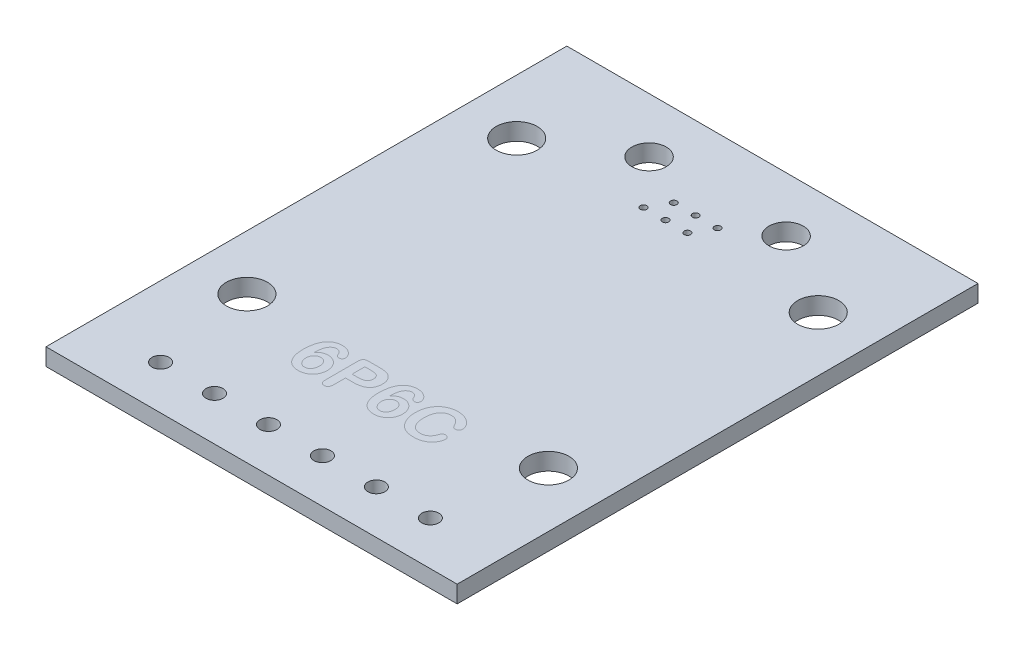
ISO-10303-21;
HEADER;
FILE_DESCRIPTION(('STEP AP214'),'2;1');
FILE_NAME('part.step','',(''),(''),'','','');
FILE_SCHEMA(('AUTOMOTIVE_DESIGN { 1 0 10303 214 1 1 1 1 }'));
ENDSEC;
DATA;
#1=APPLICATION_CONTEXT('core data for automotive mechanical design processes');
#2=APPLICATION_PROTOCOL_DEFINITION('international standard','automotive_design',2000,#1);
#3=PRODUCT_CONTEXT('',#1,'mechanical');
#4=PRODUCT('Part','Part','',(#3));
#5=PRODUCT_RELATED_PRODUCT_CATEGORY('part','',(#4));
#6=PRODUCT_DEFINITION_FORMATION('','',#4);
#7=PRODUCT_DEFINITION_CONTEXT('part definition',#1,'design');
#8=PRODUCT_DEFINITION('design','',#6,#7);
#9=PRODUCT_DEFINITION_SHAPE('','',#8);
#10=(LENGTH_UNIT() NAMED_UNIT(*) SI_UNIT(.MILLI.,.METRE.));
#11=(NAMED_UNIT(*) PLANE_ANGLE_UNIT() SI_UNIT($,.RADIAN.));
#12=(NAMED_UNIT(*) SI_UNIT($,.STERADIAN.) SOLID_ANGLE_UNIT());
#13=UNCERTAINTY_MEASURE_WITH_UNIT(LENGTH_MEASURE(1.E-05),#10,'distance_accuracy_value','');
#14=(GEOMETRIC_REPRESENTATION_CONTEXT(3) GLOBAL_UNCERTAINTY_ASSIGNED_CONTEXT((#13)) GLOBAL_UNIT_ASSIGNED_CONTEXT((#10,
#11,#12)) REPRESENTATION_CONTEXT('',''));
#15=CARTESIAN_POINT('',(0.,0.,0.));
#16=DIRECTION('',(0.,0.,1.));
#17=DIRECTION('',(1.,0.,0.));
#18=AXIS2_PLACEMENT_3D('',#15,#16,#17);
#19=CARTESIAN_POINT('',(0.,0.,0.));
#20=DIRECTION('',(0.,-1.,0.));
#21=DIRECTION('',(0.,0.,-1.));
#22=AXIS2_PLACEMENT_3D('',#19,#20,#21);
#23=PLANE('',#22);
#24=CARTESIAN_POINT('',(25.5863710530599,0.,-11.4446303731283));
#25=CARTESIAN_POINT('',(25.6095351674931,0.,-11.4434790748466));
#26=CARTESIAN_POINT('',(25.655099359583,0.,-11.4412144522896));
#27=CARTESIAN_POINT('',(25.7203905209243,0.,-11.4207034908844));
#28=CARTESIAN_POINT('',(25.7813183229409,0.,-11.3893427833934));
#29=CARTESIAN_POINT('',(25.8340423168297,0.,-11.343947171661));
#30=CARTESIAN_POINT('',(25.8794708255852,0.,-11.2908985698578));
#31=CARTESIAN_POINT('',(25.912095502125,0.,-11.2292778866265));
#32=CARTESIAN_POINT('',(25.9321368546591,0.,-11.1612102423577));
#33=CARTESIAN_POINT('',(25.9343595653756,0.,-11.113564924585));
#34=CARTESIAN_POINT('',(25.9355018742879,0.,-11.089078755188));
#35=B_SPLINE_CURVE_WITH_KNOTS('',3,(#24,#25,#26,#27,#28,#29,#30,#31,#32,#33,#34),.UNSPECIFIED.,
.F.,.F.,(4,1,1,1,1,1,1,1,4),(0.,0.125006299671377,0.245889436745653,0.366954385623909,
0.493335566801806,0.619716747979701,0.742738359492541,0.867786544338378,1.),.UNSPECIFIED.);
#36=CARTESIAN_POINT('',(25.5863710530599,0.,-11.4446303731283));
#37=VERTEX_POINT('',#36);
#38=CARTESIAN_POINT('',(25.9355018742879,0.,-11.089078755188));
#39=VERTEX_POINT('',#38);
#40=EDGE_CURVE('E11',#37,#39,#35,.T.);
#41=ORIENTED_EDGE('',*,*,#40,.F.);
#42=CARTESIAN_POINT('',(25.2155700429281,0.,-11.0834605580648));
#43=CARTESIAN_POINT('',(25.2242805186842,0.,-11.1090209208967));
#44=CARTESIAN_POINT('',(25.2411075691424,0.,-11.1583988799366));
#45=CARTESIAN_POINT('',(25.2716197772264,0.,-11.2273142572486));
#46=CARTESIAN_POINT('',(25.3047665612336,0.,-11.2888226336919));
#47=CARTESIAN_POINT('',(25.3401335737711,0.,-11.3441806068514));
#48=CARTESIAN_POINT('',(25.3851226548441,0.,-11.3902809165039));
#49=CARTESIAN_POINT('',(25.4423899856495,0.,-11.4231339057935));
#50=CARTESIAN_POINT('',(25.5111890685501,0.,-11.4412905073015));
#51=CARTESIAN_POINT('',(25.560310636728,0.,-11.4434726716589));
#52=CARTESIAN_POINT('',(25.5863710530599,0.,-11.4446303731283));
#53=B_SPLINE_CURVE_WITH_KNOTS('',3,(#42,#43,#44,#45,#46,#47,#48,#49,#50,#51,#52),.UNSPECIFIED.,
.F.,.F.,(4,1,1,1,1,1,1,1,4),(0.,0.143533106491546,0.277279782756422,0.400119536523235,
0.514929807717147,0.625575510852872,0.739029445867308,0.861547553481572,1.),.UNSPECIFIED.);
#54=CARTESIAN_POINT('',(25.2155700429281,0.,-11.0834605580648));
#55=VERTEX_POINT('',#54);
#56=EDGE_CURVE('E634',#55,#37,#53,.T.);
#57=ORIENTED_EDGE('',*,*,#56,.F.);
#58=CARTESIAN_POINT('',(24.2668973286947,0.,-10.3948301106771));
#59=CARTESIAN_POINT('',(24.2952848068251,0.,-10.3951261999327));
#60=CARTESIAN_POINT('',(24.3511359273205,0.,-10.3957087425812));
#61=CARTESIAN_POINT('',(24.4328546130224,0.,-10.4052245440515));
#62=CARTESIAN_POINT('',(24.5115393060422,0.,-10.4185295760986));
#63=CARTESIAN_POINT('',(24.586562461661,0.,-10.4379573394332));
#64=CARTESIAN_POINT('',(24.6588664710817,0.,-10.4616802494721));
#65=CARTESIAN_POINT('',(24.7269355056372,0.,-10.4927125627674));
#66=CARTESIAN_POINT('',(24.7923988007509,0.,-10.5279277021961));
#67=CARTESIAN_POINT('',(24.8543445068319,0.,-10.5688305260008));
#68=CARTESIAN_POINT('',(24.9121884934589,0.,-10.6158217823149));
#69=CARTESIAN_POINT('',(24.9668201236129,0.,-10.6673961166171));
#70=CARTESIAN_POINT('',(25.0186981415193,0.,-10.7233035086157));
#71=CARTESIAN_POINT('',(25.0648953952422,0.,-10.7858567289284));
#72=CARTESIAN_POINT('',(25.1086204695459,0.,-10.85269233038));
#73=CARTESIAN_POINT('',(25.1485242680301,0.,-10.9248635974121));
#74=CARTESIAN_POINT('',(25.1849092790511,0.,-11.0020233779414));
#75=CARTESIAN_POINT('',(25.2052385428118,0.,-11.0560193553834));
#76=CARTESIAN_POINT('',(25.2155700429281,0.,-11.0834605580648));
#77=B_SPLINE_CURVE_WITH_KNOTS('',3,(#58,#59,#60,#61,#62,#63,#64,#65,#66,#67,#68,#69,#70,#71,#72,
#73,#74,#75,#76),.UNSPECIFIED.,.F.,.F.,(4,1,1,1,1,1,1,1,1,1,1,1,1,1,1,1,4),(0.,
0.0675283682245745,0.132859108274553,0.195570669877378,0.257350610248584,0.317159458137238,
0.376450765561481,0.435150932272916,0.49396497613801,0.552841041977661,0.612306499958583,
0.672705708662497,0.734093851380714,0.797150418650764,0.862713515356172,0.930229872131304,1.),.UNSPECIFIED.);
#78=CARTESIAN_POINT('',(24.2668973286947,0.,-10.3948301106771));
#79=VERTEX_POINT('',#78);
#80=EDGE_CURVE('E642',#79,#55,#77,.T.);
#81=ORIENTED_EDGE('',*,*,#80,.F.);
#82=CARTESIAN_POINT('',(23.2106762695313,0.,-11.8001819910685));
#83=CARTESIAN_POINT('',(23.2112655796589,0.,-11.7616524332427));
#84=CARTESIAN_POINT('',(23.2124161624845,0.,-11.686426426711));
#85=CARTESIAN_POINT('',(23.217699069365,0.,-11.5757988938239));
#86=CARTESIAN_POINT('',(23.228123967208,0.,-11.4702902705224));
#87=CARTESIAN_POINT('',(23.2428486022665,0.,-11.3696978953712));
#88=CARTESIAN_POINT('',(23.2599331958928,0.,-11.2738599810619));
#89=CARTESIAN_POINT('',(23.2824628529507,0.,-11.1833222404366));
#90=CARTESIAN_POINT('',(23.3092149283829,0.,-11.0976580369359));
#91=CARTESIAN_POINT('',(23.339139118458,0.,-11.0167020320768));
#92=CARTESIAN_POINT('',(23.3744794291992,0.,-10.9411879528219));
#93=CARTESIAN_POINT('',(23.4106394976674,0.,-10.8694635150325));
#94=CARTESIAN_POINT('',(23.4516173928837,0.,-10.8033051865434));
#95=CARTESIAN_POINT('',(23.4972671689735,0.,-10.7432736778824));
#96=CARTESIAN_POINT('',(23.5443075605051,0.,-10.6864086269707));
#97=CARTESIAN_POINT('',(23.5956672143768,0.,-10.6351475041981));
#98=CARTESIAN_POINT('',(23.6506228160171,0.,-10.5891922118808));
#99=CARTESIAN_POINT('',(23.7277978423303,0.,-10.5344925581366));
#100=CARTESIAN_POINT('',(23.8323446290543,0.,-10.4780762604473));
#101=CARTESIAN_POINT('',(23.968135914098,0.,-10.4295952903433));
#102=CARTESIAN_POINT('',(24.1141962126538,0.,-10.3999637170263));
#103=CARTESIAN_POINT('',(24.2151215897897,0.,-10.3965707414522));
#104=CARTESIAN_POINT('',(24.2668973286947,0.,-10.3948301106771));
#105=B_SPLINE_CURVE_WITH_KNOTS('',3,(#82,#83,#84,#85,#86,#87,#88,#89,#90,#91,#92,#93,#94,#95,
#96,#97,#98,#99,#100,#101,#102,#103,#104),.UNSPECIFIED.,.F.,.F.,(4,1,1,1,1,1,1,1,1,1,1,1,1,1,1,
1,1,1,1,1,4),(0.,0.0580788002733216,0.113394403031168,0.166879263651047,0.217803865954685,
0.266602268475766,0.313546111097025,0.358312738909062,0.401826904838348,0.443508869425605,
0.483907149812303,0.522846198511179,0.560589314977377,0.597504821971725,0.634001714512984,
0.669780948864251,0.705359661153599,0.776449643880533,0.848004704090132,0.922024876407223,1.),.UNSPECIFIED.);
#106=CARTESIAN_POINT('',(23.2106762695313,0.,-11.8001819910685));
#107=VERTEX_POINT('',#106);
#108=EDGE_CURVE('E650',#107,#79,#105,.T.);
#109=ORIENTED_EDGE('',*,*,#108,.F.);
#110=CARTESIAN_POINT('',(24.2941857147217,0.,-13.2713470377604));
#111=CARTESIAN_POINT('',(24.25397249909,0.,-13.2704654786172));
#112=CARTESIAN_POINT('',(24.1749721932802,0.,-13.2687336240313));
#113=CARTESIAN_POINT('',(24.059907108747,0.,-13.2492586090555));
#114=CARTESIAN_POINT('',(23.9508074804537,0.,-13.2202723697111));
#115=CARTESIAN_POINT('',(23.8483878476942,0.,-13.1775209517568));
#116=CARTESIAN_POINT('',(23.7517850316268,0.,-13.1240545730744));
#117=CARTESIAN_POINT('',(23.6619666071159,0.,-13.0573639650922));
#118=CARTESIAN_POINT('',(23.5789286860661,0.,-12.9785939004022));
#119=CARTESIAN_POINT('',(23.5018356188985,0.,-12.8888042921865));
#120=CARTESIAN_POINT('',(23.4328881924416,0.,-12.7876189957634));
#121=CARTESIAN_POINT('',(23.3735978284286,0.,-12.6759622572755));
#122=CARTESIAN_POINT('',(23.3225247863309,0.,-12.5549727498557));
#123=CARTESIAN_POINT('',(23.2824073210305,0.,-12.4232237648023));
#124=CARTESIAN_POINT('',(23.2487991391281,0.,-12.2818620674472));
#125=CARTESIAN_POINT('',(23.2274335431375,0.,-12.1297712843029));
#126=CARTESIAN_POINT('',(23.2133727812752,0.,-11.9681910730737));
#127=CARTESIAN_POINT('',(23.2115913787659,0.,-11.8571988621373));
#128=CARTESIAN_POINT('',(23.2106762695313,0.,-11.8001819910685));
#129=B_SPLINE_CURVE_WITH_KNOTS('',3,(#110,#111,#112,#113,#114,#115,#116,#117,#118,#119,#120,
#121,#122,#123,#124,#125,#126,#127,#128),.UNSPECIFIED.,.F.,.F.,(4,1,1,1,1,1,1,1,1,1,1,1,1,1,1,1,
4),(0.,0.0585447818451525,0.115013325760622,0.169587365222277,0.222730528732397,
0.276313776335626,0.330117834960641,0.385279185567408,0.442790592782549,0.502266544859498,
0.563316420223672,0.626746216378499,0.693333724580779,0.763788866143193,0.838279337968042,
0.916923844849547,1.),.UNSPECIFIED.);
#130=CARTESIAN_POINT('',(24.2941857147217,0.,-13.2713470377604));
#131=VERTEX_POINT('',#130);
#132=EDGE_CURVE('E658',#131,#107,#129,.T.);
#133=ORIENTED_EDGE('',*,*,#132,.F.);
#134=CARTESIAN_POINT('',(25.188281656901,0.,-12.6734103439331));
#135=CARTESIAN_POINT('',(25.1619804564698,0.,-12.7208342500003));
#136=CARTESIAN_POINT('',(25.1112401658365,0.,-12.8123244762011));
#137=CARTESIAN_POINT('',(25.0217465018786,0.,-12.9350954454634));
#138=CARTESIAN_POINT('',(24.9251687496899,0.,-13.0388428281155));
#139=CARTESIAN_POINT('',(24.8210525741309,0.,-13.1245346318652));
#140=CARTESIAN_POINT('',(24.7062306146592,0.,-13.1908855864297));
#141=CARTESIAN_POINT('',(24.5798429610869,0.,-13.2387139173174));
#142=CARTESIAN_POINT('',(24.4405983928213,0.,-13.2658095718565));
#143=CARTESIAN_POINT('',(24.3440638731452,0.,-13.2694605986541));
#144=CARTESIAN_POINT('',(24.2941857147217,0.,-13.2713470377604));
#145=B_SPLINE_CURVE_WITH_KNOTS('',3,(#134,#135,#136,#137,#138,#139,#140,#141,#142,#143,#144),
.UNSPECIFIED.,.F.,.F.,(4,1,1,1,1,1,1,1,4),(0.,0.142603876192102,0.275111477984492,
0.398634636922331,0.514744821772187,0.628615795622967,0.746035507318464,0.868779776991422,1.),.UNSPECIFIED.);
#146=CARTESIAN_POINT('',(25.188281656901,0.,-12.6734103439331));
#147=VERTEX_POINT('',#146);
#148=EDGE_CURVE('E666',#147,#131,#145,.T.);
#149=ORIENTED_EDGE('',*,*,#148,.F.);
#150=CARTESIAN_POINT('',(25.5919892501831,0.,-12.3427393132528));
#151=CARTESIAN_POINT('',(25.5678504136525,0.,-12.3436494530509));
#152=CARTESIAN_POINT('',(25.522086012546,0.,-12.3453749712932));
#153=CARTESIAN_POINT('',(25.4579619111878,0.,-12.3584823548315));
#154=CARTESIAN_POINT('',(25.4034483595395,0.,-12.3819281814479));
#155=CARTESIAN_POINT('',(25.3572166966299,0.,-12.4161735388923));
#156=CARTESIAN_POINT('',(25.3175184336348,0.,-12.4634519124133));
#157=CARTESIAN_POINT('',(25.2760674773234,0.,-12.5213579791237));
#158=CARTESIAN_POINT('',(25.2318276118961,0.,-12.5924159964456));
#159=CARTESIAN_POINT('',(25.2034803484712,0.,-12.6451411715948));
#160=CARTESIAN_POINT('',(25.188281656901,0.,-12.6734103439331));
#161=B_SPLINE_CURVE_WITH_KNOTS('',3,(#150,#151,#152,#153,#154,#155,#156,#157,#158,#159,#160),
.UNSPECIFIED.,.F.,.F.,(4,1,1,1,1,1,1,1,4),(0.,0.12950372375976,0.245523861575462,
0.349026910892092,0.445510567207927,0.551269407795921,0.678784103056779,0.827776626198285,1.),.UNSPECIFIED.);
#162=CARTESIAN_POINT('',(25.5919892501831,0.,-12.3427393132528));
#163=VERTEX_POINT('',#162);
#164=EDGE_CURVE('E674',#163,#147,#161,.T.);
#165=ORIENTED_EDGE('',*,*,#164,.F.);
#166=CARTESIAN_POINT('',(25.9250680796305,0.,-12.6902649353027));
#167=CARTESIAN_POINT('',(25.9237181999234,0.,-12.6679602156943));
#168=CARTESIAN_POINT('',(25.9210563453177,0.,-12.6239770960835));
#169=CARTESIAN_POINT('',(25.9031935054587,0.,-12.5595994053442));
#170=CARTESIAN_POINT('',(25.8706107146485,0.,-12.5007118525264));
#171=CARTESIAN_POINT('',(25.8288032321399,0.,-12.4465833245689));
#172=CARTESIAN_POINT('',(25.7780867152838,0.,-12.4010284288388));
#173=CARTESIAN_POINT('',(25.7208539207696,0.,-12.3673986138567));
#174=CARTESIAN_POINT('',(25.6582179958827,0.,-12.345930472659));
#175=CARTESIAN_POINT('',(25.6143677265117,0.,-12.3438175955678));
#176=CARTESIAN_POINT('',(25.5919892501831,0.,-12.3427393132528));
#177=B_SPLINE_CURVE_WITH_KNOTS('',3,(#166,#167,#168,#169,#170,#171,#172,#173,#174,#175,#176),
.UNSPECIFIED.,.F.,.F.,(4,1,1,1,1,1,1,1,4),(0.,0.125650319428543,0.24777236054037,
0.37248853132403,0.502403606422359,0.631547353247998,0.753790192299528,0.874349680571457,1.),.UNSPECIFIED.);
#178=CARTESIAN_POINT('',(25.9250680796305,0.,-12.6902649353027));
#179=VERTEX_POINT('',#178);
#180=EDGE_CURVE('E682',#179,#163,#177,.T.);
#181=ORIENTED_EDGE('',*,*,#180,.F.);
#182=CARTESIAN_POINT('',(24.2885675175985,0.,-13.8877435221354));
#183=CARTESIAN_POINT('',(24.3281768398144,0.,-13.8870650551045));
#184=CARTESIAN_POINT('',(24.4064231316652,0.,-13.8857247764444));
#185=CARTESIAN_POINT('',(24.5222171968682,0.,-13.8769367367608));
#186=CARTESIAN_POINT('',(24.634708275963,0.,-13.8615526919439));
#187=CARTESIAN_POINT('',(24.7440172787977,0.,-13.8406719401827));
#188=CARTESIAN_POINT('',(24.8500749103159,0.,-13.8145536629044));
#189=CARTESIAN_POINT('',(24.9526532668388,0.,-13.7812282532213));
#190=CARTESIAN_POINT('',(25.051882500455,0.,-13.742176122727));
#191=CARTESIAN_POINT('',(25.1471728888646,0.,-13.6968926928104));
#192=CARTESIAN_POINT('',(25.2383927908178,0.,-13.6483823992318));
#193=CARTESIAN_POINT('',(25.3241621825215,0.,-13.5960379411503));
#194=CARTESIAN_POINT('',(25.4049026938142,0.,-13.5416183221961));
#195=CARTESIAN_POINT('',(25.4797114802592,0.,-13.4834234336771));
#196=CARTESIAN_POINT('',(25.5495036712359,0.,-13.4229717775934));
#197=CARTESIAN_POINT('',(25.6130012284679,0.,-13.3588826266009));
#198=CARTESIAN_POINT('',(25.6721768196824,0.,-13.2932976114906));
#199=CARTESIAN_POINT('',(25.7244458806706,0.,-13.2242919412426));
#200=CARTESIAN_POINT('',(25.7718683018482,0.,-13.1552160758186));
#201=CARTESIAN_POINT('',(25.8120169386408,0.,-13.0856751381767));
#202=CARTESIAN_POINT('',(25.8463846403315,0.,-13.0175396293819));
#203=CARTESIAN_POINT('',(25.8762197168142,0.,-12.9507771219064));
#204=CARTESIAN_POINT('',(25.8975885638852,0.,-12.8841727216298));
#205=CARTESIAN_POINT('',(25.9128528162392,0.,-12.818651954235));
#206=CARTESIAN_POINT('',(25.9232030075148,0.,-12.7542644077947));
#207=CARTESIAN_POINT('',(25.9244510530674,0.,-12.7114380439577));
#208=CARTESIAN_POINT('',(25.9250680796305,0.,-12.6902649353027));
#209=B_SPLINE_CURVE_WITH_KNOTS('',3,(#182,#183,#184,#185,#186,#187,#188,#189,#190,#191,#192,
#193,#194,#195,#196,#197,#198,#199,#200,#201,#202,#203,#204,#205,#206,#207,#208),.UNSPECIFIED.,
.F.,.F.,(4,1,1,1,1,1,1,1,1,1,1,1,1,1,1,1,1,1,1,1,1,1,1,1,4),(0.,0.0535291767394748,
0.105744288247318,0.156825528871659,0.206887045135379,0.256080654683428,0.304331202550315,
0.352537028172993,0.400087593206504,0.446834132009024,0.492098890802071,0.535821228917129,
0.578344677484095,0.620111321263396,0.660504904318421,0.700198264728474,0.739392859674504,
0.777398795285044,0.813365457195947,0.847805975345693,0.880515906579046,0.912072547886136,
0.942153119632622,0.971400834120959,1.),.UNSPECIFIED.);
#210=CARTESIAN_POINT('',(24.2885675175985,0.,-13.8877435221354));
#211=VERTEX_POINT('',#210);
#212=EDGE_CURVE('E690',#211,#179,#209,.T.);
#213=ORIENTED_EDGE('',*,*,#212,.F.);
#214=CARTESIAN_POINT('',(22.3888142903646,0.,-11.8154313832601));
#215=CARTESIAN_POINT('',(22.3903922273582,0.,-11.8939027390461));
#216=CARTESIAN_POINT('',(22.3934714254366,0.,-12.0470323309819));
#217=CARTESIAN_POINT('',(22.4208414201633,0.,-12.270084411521));
#218=CARTESIAN_POINT('',(22.4632800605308,0.,-12.4810241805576));
#219=CARTESIAN_POINT('',(22.5253787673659,0.,-12.6786965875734));
#220=CARTESIAN_POINT('',(22.6036003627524,0.,-12.8634660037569));
#221=CARTESIAN_POINT('',(22.6962157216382,0.,-13.0351001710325));
#222=CARTESIAN_POINT('',(22.8058546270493,0.,-13.1920776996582));
#223=CARTESIAN_POINT('',(22.9292784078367,0.,-13.3349620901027));
#224=CARTESIAN_POINT('',(23.0660998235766,0.,-13.4628463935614));
#225=CARTESIAN_POINT('',(23.2141972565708,0.,-13.5749683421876));
#226=CARTESIAN_POINT('',(23.3736092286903,0.,-13.6702645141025));
#227=CARTESIAN_POINT('',(23.5431357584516,0.,-13.7489141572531));
#228=CARTESIAN_POINT('',(23.7211032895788,0.,-13.8101303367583));
#229=CARTESIAN_POINT('',(23.9051931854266,0.,-13.8557905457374));
#230=CARTESIAN_POINT('',(24.0951455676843,0.,-13.8826766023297));
#231=CARTESIAN_POINT('',(24.2237408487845,0.,-13.8860453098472));
#232=CARTESIAN_POINT('',(24.2885675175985,0.,-13.8877435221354));
#233=B_SPLINE_CURVE_WITH_KNOTS('',3,(#214,#215,#216,#217,#218,#219,#220,#221,#222,#223,#224,
#225,#226,#227,#228,#229,#230,#231,#232),.UNSPECIFIED.,.F.,.F.,(4,1,1,1,1,1,1,1,1,1,1,1,1,1,1,1,
4),(0.,0.0745054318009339,0.145390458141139,0.213116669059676,0.278617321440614,
0.341812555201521,0.403443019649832,0.463500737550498,0.523310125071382,0.582457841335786,
0.641054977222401,0.699406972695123,0.75852411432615,0.818232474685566,0.877890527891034,
0.938442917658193,1.),.UNSPECIFIED.);
#234=CARTESIAN_POINT('',(22.3888142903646,0.,-11.8154313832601));
#235=VERTEX_POINT('',#234);
#236=EDGE_CURVE('E698',#235,#211,#233,.T.);
#237=ORIENTED_EDGE('',*,*,#236,.F.);
#238=CARTESIAN_POINT('',(22.883215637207,0.,-10.3346351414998));
#239=CARTESIAN_POINT('',(22.8574224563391,0.,-10.366714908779));
#240=CARTESIAN_POINT('',(22.8057235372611,0.,-10.4310144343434));
#241=CARTESIAN_POINT('',(22.7345797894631,0.,-10.5333430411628));
#242=CARTESIAN_POINT('',(22.6711504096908,0.,-10.6421883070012));
#243=CARTESIAN_POINT('',(22.6108666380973,0.,-10.755001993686));
#244=CARTESIAN_POINT('',(22.5593972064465,0.,-10.8739918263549));
#245=CARTESIAN_POINT('',(22.5134869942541,0.,-10.996568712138));
#246=CARTESIAN_POINT('',(22.4746239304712,0.,-11.1232948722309));
#247=CARTESIAN_POINT('',(22.4438576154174,0.,-11.2542484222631));
#248=CARTESIAN_POINT('',(22.4183330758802,0.,-11.388845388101));
#249=CARTESIAN_POINT('',(22.4024974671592,0.,-11.5278326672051));
#250=CARTESIAN_POINT('',(22.3900999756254,0.,-11.6702065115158));
#251=CARTESIAN_POINT('',(22.3892456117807,0.,-11.7667113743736));
#252=CARTESIAN_POINT('',(22.3888142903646,0.,-11.8154313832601));
#253=B_SPLINE_CURVE_WITH_KNOTS('',3,(#238,#239,#240,#241,#242,#243,#244,#245,#246,#247,#248,
#249,#250,#251,#252),.UNSPECIFIED.,.F.,.F.,(4,1,1,1,1,1,1,1,1,1,1,1,4),(0.,0.0774646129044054,
0.155267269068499,0.234285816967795,0.314470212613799,0.395866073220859,0.478081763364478,
0.560751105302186,0.645146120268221,0.731170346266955,0.818423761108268,0.908332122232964,1.),.UNSPECIFIED.);
#254=CARTESIAN_POINT('',(22.883215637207,0.,-10.3346351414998));
#255=VERTEX_POINT('',#254);
#256=EDGE_CURVE('E706',#255,#235,#253,.T.);
#257=ORIENTED_EDGE('',*,*,#256,.F.);
#258=CARTESIAN_POINT('',(24.3102377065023,0.,-9.77843362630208));
#259=CARTESIAN_POINT('',(24.2591131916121,0.,-9.7788631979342));
#260=CARTESIAN_POINT('',(24.1591399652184,0.,-9.77970321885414));
#261=CARTESIAN_POINT('',(24.0126648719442,0.,-9.79173582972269));
#262=CARTESIAN_POINT('',(23.8729982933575,0.,-9.80884034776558));
#263=CARTESIAN_POINT('',(23.7401513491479,0.,-9.83343746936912));
#264=CARTESIAN_POINT('',(23.6138762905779,0.,-9.86665899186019));
#265=CARTESIAN_POINT('',(23.4937595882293,0.,-9.90750940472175));
#266=CARTESIAN_POINT('',(23.37885290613,0.,-9.95559313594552));
#267=CARTESIAN_POINT('',(23.2700930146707,0.,-10.0127946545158));
#268=CARTESIAN_POINT('',(23.1664185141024,0.,-10.0794435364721));
#269=CARTESIAN_POINT('',(23.0671711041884,0.,-10.1548561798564));
#270=CARTESIAN_POINT('',(22.9713310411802,0.,-10.2393981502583));
#271=CARTESIAN_POINT('',(22.9129163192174,0.,-10.3025340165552));
#272=CARTESIAN_POINT('',(22.883215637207,0.,-10.3346351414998));
#273=B_SPLINE_CURVE_WITH_KNOTS('',3,(#258,#259,#260,#261,#262,#263,#264,#265,#266,#267,#268,
#269,#270,#271,#272),.UNSPECIFIED.,.F.,.F.,(4,1,1,1,1,1,1,1,1,1,1,1,4),(0.,0.0968665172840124,
0.189421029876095,0.278348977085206,0.363474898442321,0.445259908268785,0.52559228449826,
0.603755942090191,0.681096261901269,0.758173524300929,0.837070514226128,0.917159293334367,1.),.UNSPECIFIED.);
#274=CARTESIAN_POINT('',(24.3102377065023,0.,-9.77843362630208));
#275=VERTEX_POINT('',#274);
#276=EDGE_CURVE('E714',#275,#255,#273,.T.);
#277=ORIENTED_EDGE('',*,*,#276,.F.);
#278=CARTESIAN_POINT('',(25.9355018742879,0.,-11.089078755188));
#279=CARTESIAN_POINT('',(25.9344117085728,0.,-11.0571656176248));
#280=CARTESIAN_POINT('',(25.9321608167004,0.,-10.9912737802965));
#281=CARTESIAN_POINT('',(25.9132305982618,0.,-10.8910415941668));
#282=CARTESIAN_POINT('',(25.8842391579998,0.,-10.7867562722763));
#283=CARTESIAN_POINT('',(25.8430167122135,0.,-10.6796293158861));
#284=CARTESIAN_POINT('',(25.7906646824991,0.,-10.570358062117));
#285=CARTESIAN_POINT('',(25.7227985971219,0.,-10.4623368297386));
#286=CARTESIAN_POINT('',(25.6424827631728,0.,-10.3548077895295));
#287=CARTESIAN_POINT('',(25.5489814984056,0.,-10.2491070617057));
#288=CARTESIAN_POINT('',(25.4421297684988,0.,-10.1487709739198));
#289=CARTESIAN_POINT('',(25.3200027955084,0.,-10.058111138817));
#290=CARTESIAN_POINT('',(25.1843414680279,0.,-9.97750912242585));
#291=CARTESIAN_POINT('',(25.0353211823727,0.,-9.90650719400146));
#292=CARTESIAN_POINT('',(24.8730299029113,0.,-9.84812698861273));
#293=CARTESIAN_POINT('',(24.696530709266,0.,-9.8079998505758));
#294=CARTESIAN_POINT('',(24.5076232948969,0.,-9.7824824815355));
#295=CARTESIAN_POINT('',(24.3772074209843,0.,-9.77980733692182));
#296=CARTESIAN_POINT('',(24.3102377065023,0.,-9.77843362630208));
#297=B_SPLINE_CURVE_WITH_KNOTS('',3,(#278,#279,#280,#281,#282,#283,#284,#285,#286,#287,#288,
#289,#290,#291,#292,#293,#294,#295,#296),.UNSPECIFIED.,.F.,.F.,(4,1,1,1,1,1,1,1,1,1,1,1,1,1,1,1,
4),(0.,0.0414833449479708,0.0856516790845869,0.132258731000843,0.182153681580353,
0.234760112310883,0.2896125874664,0.347798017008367,0.409180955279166,0.472952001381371,
0.538097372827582,0.606611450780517,0.677903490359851,0.752531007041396,0.830442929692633,
0.9129309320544,1.),.UNSPECIFIED.);
#298=EDGE_CURVE('E48',#39,#275,#297,.T.);
#299=ORIENTED_EDGE('',*,*,#298,.F.);
#300=EDGE_LOOP('',(#41,#57,#81,#109,#133,#149,#165,#181,#213,#237,#257,#277,#299));
#301=FACE_BOUND('',#300,.T.);
#302=ADVANCED_FACE('F37',(#301),#23,.F.);
#303=CARTESIAN_POINT('',(20.0885638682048,0.,-13.0113047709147));
#304=CARTESIAN_POINT('',(20.0724251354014,0.,-12.9848838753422));
#305=CARTESIAN_POINT('',(20.0382843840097,0.,-12.9289916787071));
#306=CARTESIAN_POINT('',(19.9973830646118,0.,-12.833282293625));
#307=CARTESIAN_POINT('',(19.9617829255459,0.,-12.7237991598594));
#308=CARTESIAN_POINT('',(19.9305103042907,0.,-12.600171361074));
#309=CARTESIAN_POINT('',(19.9046255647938,0.,-12.4623453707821));
#310=CARTESIAN_POINT('',(19.8829019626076,0.,-12.3102713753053));
#311=CARTESIAN_POINT('',(19.8671764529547,0.,-12.1439238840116));
#312=CARTESIAN_POINT('',(19.8607552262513,0.,-12.0281472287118));
#313=CARTESIAN_POINT('',(19.8574151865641,0.,-11.9679253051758));
#314=B_SPLINE_CURVE_WITH_KNOTS('',3,(#303,#304,#305,#306,#307,#308,#309,#310,#311,#312,#313),
.UNSPECIFIED.,.F.,.F.,(4,1,1,1,1,1,1,1,4),(0.,0.0859403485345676,0.181802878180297,
0.288297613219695,0.405676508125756,0.535875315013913,0.677806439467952,0.832409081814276,1.),.UNSPECIFIED.);
#315=CARTESIAN_POINT('',(20.0885638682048,0.,-13.0113047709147));
#316=VERTEX_POINT('',#315);
#317=CARTESIAN_POINT('',(19.8574151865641,0.,-11.9679253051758));
#318=VERTEX_POINT('',#317);
#319=EDGE_CURVE('E593',#316,#318,#314,.T.);
#320=ORIENTED_EDGE('',*,*,#319,.F.);
#321=CARTESIAN_POINT('',(20.6086484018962,0.,-13.3227134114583));
#322=CARTESIAN_POINT('',(20.5850397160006,0.,-13.3214529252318));
#323=CARTESIAN_POINT('',(20.5370929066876,0.,-13.3188930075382));
#324=CARTESIAN_POINT('',(20.4652517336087,0.,-13.3034440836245));
#325=CARTESIAN_POINT('',(20.3940281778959,0.,-13.276154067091));
#326=CARTESIAN_POINT('',(20.3240431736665,0.,-13.2394430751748));
#327=CARTESIAN_POINT('',(20.2569811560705,0.,-13.1939367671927));
#328=CARTESIAN_POINT('',(20.1946353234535,0.,-13.1402894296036));
#329=CARTESIAN_POINT('',(20.1374764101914,0.,-13.0797001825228));
#330=CARTESIAN_POINT('',(20.1049197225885,0.,-13.0341754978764));
#331=CARTESIAN_POINT('',(20.0885638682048,0.,-13.0113047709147));
#332=B_SPLINE_CURVE_WITH_KNOTS('',3,(#321,#322,#323,#324,#325,#326,#327,#328,#329,#330,#331),
.UNSPECIFIED.,.F.,.F.,(4,1,1,1,1,1,1,1,4),(0.,0.112527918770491,0.228532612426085,
0.348334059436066,0.474908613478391,0.604307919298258,0.733581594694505,0.866156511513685,1.),.UNSPECIFIED.);
#333=CARTESIAN_POINT('',(20.6086484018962,0.,-13.3227134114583));
#334=VERTEX_POINT('',#333);
#335=EDGE_CURVE('E512',#334,#316,#332,.T.);
#336=ORIENTED_EDGE('',*,*,#335,.F.);
#337=CARTESIAN_POINT('',(21.1158913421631,0.,-12.9527150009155));
#338=CARTESIAN_POINT('',(21.1048432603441,0.,-12.9795481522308));
#339=CARTESIAN_POINT('',(21.0831258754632,0.,-13.0322944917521));
#340=CARTESIAN_POINT('',(21.0384882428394,0.,-13.1045377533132));
#341=CARTESIAN_POINT('',(20.9839298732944,0.,-13.1677417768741));
#342=CARTESIAN_POINT('',(20.9212040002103,0.,-13.222234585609));
#343=CARTESIAN_POINT('',(20.8520736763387,0.,-13.2677310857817));
#344=CARTESIAN_POINT('',(20.7754902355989,0.,-13.2992259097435));
#345=CARTESIAN_POINT('',(20.6939469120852,0.,-13.3192317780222));
#346=CARTESIAN_POINT('',(20.6373925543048,0.,-13.3215401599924));
#347=CARTESIAN_POINT('',(20.6086484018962,0.,-13.3227134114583));
#348=B_SPLINE_CURVE_WITH_KNOTS('',3,(#337,#338,#339,#340,#341,#342,#343,#344,#345,#346,#347),
.UNSPECIFIED.,.F.,.F.,(4,1,1,1,1,1,1,1,4),(0.,0.129794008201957,0.255138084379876,
0.37832801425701,0.502301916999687,0.626258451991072,0.747077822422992,0.871450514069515,1.),.UNSPECIFIED.);
#349=CARTESIAN_POINT('',(21.1158913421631,0.,-12.9527150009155));
#350=VERTEX_POINT('',#349);
#351=EDGE_CURVE('E521',#350,#334,#348,.T.);
#352=ORIENTED_EDGE('',*,*,#351,.F.);
#353=CARTESIAN_POINT('',(21.4690351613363,0.,-12.6661869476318));
#354=CARTESIAN_POINT('',(21.4504775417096,0.,-12.667099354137));
#355=CARTESIAN_POINT('',(21.4133313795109,0.,-12.6689256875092));
#356=CARTESIAN_POINT('',(21.3591306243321,0.,-12.6842255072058));
#357=CARTESIAN_POINT('',(21.3068462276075,0.,-12.7078978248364));
#358=CARTESIAN_POINT('',(21.2572120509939,0.,-12.7406142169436));
#359=CARTESIAN_POINT('',(21.2124886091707,0.,-12.7827993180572));
#360=CARTESIAN_POINT('',(21.172394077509,0.,-12.8319517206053));
#361=CARTESIAN_POINT('',(21.1405675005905,0.,-12.8897372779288));
#362=CARTESIAN_POINT('',(21.1242509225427,0.,-12.9313799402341));
#363=CARTESIAN_POINT('',(21.1158913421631,0.,-12.9527150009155));
#364=B_SPLINE_CURVE_WITH_KNOTS('',3,(#353,#354,#355,#356,#357,#358,#359,#360,#361,#362,#363),
.UNSPECIFIED.,.F.,.F.,(4,1,1,1,1,1,1,1,4),(0.,0.114479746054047,0.229150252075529,
0.345288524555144,0.468148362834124,0.594461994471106,0.723789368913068,0.85848718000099,1.),.UNSPECIFIED.);
#365=CARTESIAN_POINT('',(21.4690351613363,0.,-12.6661869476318));
#366=VERTEX_POINT('',#365);
#367=EDGE_CURVE('E529',#366,#350,#364,.T.);
#368=ORIENTED_EDGE('',*,*,#367,.F.);
#369=CARTESIAN_POINT('',(21.7651944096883,0.,-12.9639513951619));
#370=CARTESIAN_POINT('',(21.7644638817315,0.,-12.9453464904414));
#371=CARTESIAN_POINT('',(21.7630160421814,0.,-12.9084732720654));
#372=CARTESIAN_POINT('',(21.7452101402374,0.,-12.8552091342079));
#373=CARTESIAN_POINT('',(21.7198202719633,0.,-12.8038131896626));
#374=CARTESIAN_POINT('',(21.6828561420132,0.,-12.7573122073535));
#375=CARTESIAN_POINT('',(21.6387424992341,0.,-12.7172325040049));
#376=CARTESIAN_POINT('',(21.5875128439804,0.,-12.6873574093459));
#377=CARTESIAN_POINT('',(21.5301939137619,0.,-12.6689568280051));
#378=CARTESIAN_POINT('',(21.4897738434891,0.,-12.6671262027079));
#379=CARTESIAN_POINT('',(21.4690351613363,0.,-12.6661869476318));
#380=B_SPLINE_CURVE_WITH_KNOTS('',3,(#369,#370,#371,#372,#373,#374,#375,#376,#377,#378,#379),
.UNSPECIFIED.,.F.,.F.,(4,1,1,1,1,1,1,1,4),(0.,0.119372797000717,0.236585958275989,
0.358373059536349,0.48731617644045,0.61670775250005,0.740274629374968,0.866740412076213,1.),.UNSPECIFIED.);
#381=CARTESIAN_POINT('',(21.7651944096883,0.,-12.9639513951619));
#382=VERTEX_POINT('',#381);
#383=EDGE_CURVE('E537',#382,#366,#380,.T.);
#384=ORIENTED_EDGE('',*,*,#383,.F.);
#385=CARTESIAN_POINT('',(20.6263055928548,0.,-13.8363771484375));
#386=CARTESIAN_POINT('',(20.6823206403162,0.,-13.8347041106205));
#387=CARTESIAN_POINT('',(20.7914884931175,0.,-13.8314435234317));
#388=CARTESIAN_POINT('',(20.9500404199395,0.,-13.8054199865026));
#389=CARTESIAN_POINT('',(21.0981366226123,0.,-13.7621541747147));
#390=CARTESIAN_POINT('',(21.2343308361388,0.,-13.7016740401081));
#391=CARTESIAN_POINT('',(21.3574075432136,0.,-13.6290521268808));
#392=CARTESIAN_POINT('',(21.4658044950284,0.,-13.5472519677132));
#393=CARTESIAN_POINT('',(21.5578010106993,0.,-13.45667795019));
#394=CARTESIAN_POINT('',(21.6320225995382,0.,-13.3586986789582));
#395=CARTESIAN_POINT('',(21.6904307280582,0.,-13.2584160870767));
#396=CARTESIAN_POINT('',(21.7327203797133,0.,-13.1587024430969));
#397=CARTESIAN_POINT('',(21.7606126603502,0.,-13.0609747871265));
#398=CARTESIAN_POINT('',(21.7636955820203,0.,-12.9956906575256));
#399=CARTESIAN_POINT('',(21.7651944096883,0.,-12.9639513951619));
#400=B_SPLINE_CURVE_WITH_KNOTS('',3,(#385,#386,#387,#388,#389,#390,#391,#392,#393,#394,#395,
#396,#397,#398,#399),.UNSPECIFIED.,.F.,.F.,(4,1,1,1,1,1,1,1,1,1,1,1,4),(0.,0.106398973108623,
0.207361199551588,0.304361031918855,0.398823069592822,0.489761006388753,0.575374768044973,
0.656258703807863,0.734246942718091,0.808277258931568,0.876166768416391,0.93979585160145,1.),.UNSPECIFIED.);
#401=CARTESIAN_POINT('',(20.6263055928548,0.,-13.8363771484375));
#402=VERTEX_POINT('',#401);
#403=EDGE_CURVE('E545',#402,#382,#400,.T.);
#404=ORIENTED_EDGE('',*,*,#403,.F.);
#405=CARTESIAN_POINT('',(19.1013663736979,0.,-11.7183168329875));
#406=CARTESIAN_POINT('',(19.1024503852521,0.,-11.8012970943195));
#407=CARTESIAN_POINT('',(19.1045623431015,0.,-11.9629658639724));
#408=CARTESIAN_POINT('',(19.1252557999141,0.,-12.1988149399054));
#409=CARTESIAN_POINT('',(19.1575329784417,0.,-12.4211402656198));
#410=CARTESIAN_POINT('',(19.2028495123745,0.,-12.6294648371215));
#411=CARTESIAN_POINT('',(19.2613104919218,0.,-12.8220960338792));
#412=CARTESIAN_POINT('',(19.3306114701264,0.,-12.9986189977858));
#413=CARTESIAN_POINT('',(19.4119436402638,0.,-13.157844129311));
#414=CARTESIAN_POINT('',(19.5041938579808,0.,-13.3006274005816));
#415=CARTESIAN_POINT('',(19.6094077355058,0.,-13.4253239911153));
#416=CARTESIAN_POINT('',(19.7239553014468,0.,-13.5352144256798));
#417=CARTESIAN_POINT('',(19.8497617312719,0.,-13.6278344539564));
#418=CARTESIAN_POINT('',(19.9859872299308,0.,-13.7039516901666));
#419=CARTESIAN_POINT('',(20.1320519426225,0.,-13.7635477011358));
#420=CARTESIAN_POINT('',(20.2882626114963,0.,-13.8062990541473));
#421=CARTESIAN_POINT('',(20.4542897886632,0.,-13.8311120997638));
#422=CARTESIAN_POINT('',(20.5681679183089,0.,-13.8345976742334));
#423=CARTESIAN_POINT('',(20.6263055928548,0.,-13.8363771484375));
#424=B_SPLINE_CURVE_WITH_KNOTS('',3,(#405,#406,#407,#408,#409,#410,#411,#412,#413,#414,#415,
#416,#417,#418,#419,#420,#421,#422,#423),.UNSPECIFIED.,.F.,.F.,(4,1,1,1,1,1,1,1,1,1,1,1,1,1,1,1,
4),(0.,0.0844198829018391,0.164473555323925,0.240703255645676,0.312898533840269,
0.381189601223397,0.44534043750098,0.505607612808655,0.562841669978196,0.617913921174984,
0.671252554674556,0.724012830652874,0.776420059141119,0.829652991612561,0.884138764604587,
0.940849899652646,1.),.UNSPECIFIED.);
#425=CARTESIAN_POINT('',(19.1013663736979,0.,-11.7183168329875));
#426=VERTEX_POINT('',#425);
#427=EDGE_CURVE('E553',#426,#402,#424,.T.);
#428=ORIENTED_EDGE('',*,*,#427,.F.);
#429=CARTESIAN_POINT('',(20.5612950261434,0.,-9.77843362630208));
#430=CARTESIAN_POINT('',(20.5240839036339,0.,-9.77897576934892));
#431=CARTESIAN_POINT('',(20.4508466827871,0.,-9.78004279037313));
#432=CARTESIAN_POINT('',(20.3430036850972,0.,-9.79068948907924));
#433=CARTESIAN_POINT('',(20.2392904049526,0.,-9.80845677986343));
#434=CARTESIAN_POINT('',(20.1391208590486,0.,-9.83239957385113));
#435=CARTESIAN_POINT('',(20.043100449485,0.,-9.86366930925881));
#436=CARTESIAN_POINT('',(19.9507418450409,0.,-9.90164933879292));
#437=CARTESIAN_POINT('',(19.862331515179,0.,-9.94656543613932));
#438=CARTESIAN_POINT('',(19.7781206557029,0.,-9.99878036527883));
#439=CARTESIAN_POINT('',(19.6981165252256,0.,-10.057792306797));
#440=CARTESIAN_POINT('',(19.6227106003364,0.,-10.1233278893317));
#441=CARTESIAN_POINT('',(19.5527685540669,0.,-10.196392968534));
#442=CARTESIAN_POINT('',(19.4867101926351,0.,-10.2747664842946));
#443=CARTESIAN_POINT('',(19.4262315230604,0.,-10.3605315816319));
#444=CARTESIAN_POINT('',(19.3712275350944,0.,-10.4532142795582));
#445=CARTESIAN_POINT('',(19.3194689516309,0.,-10.5517207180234));
#446=CARTESIAN_POINT('',(19.2740598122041,0.,-10.6573951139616));
#447=CARTESIAN_POINT('',(19.2329228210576,0.,-10.7689939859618));
#448=CARTESIAN_POINT('',(19.1977922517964,0.,-10.8870002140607));
#449=CARTESIAN_POINT('',(19.1684669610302,0.,-11.0109007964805));
#450=CARTESIAN_POINT('',(19.1430066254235,0.,-11.1403498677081));
#451=CARTESIAN_POINT('',(19.1252077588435,0.,-11.2763276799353));
#452=CARTESIAN_POINT('',(19.1117224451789,0.,-11.4182070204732));
#453=CARTESIAN_POINT('',(19.1022346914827,0.,-11.5662306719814));
#454=CARTESIAN_POINT('',(19.1016597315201,0.,-11.6669351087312));
#455=CARTESIAN_POINT('',(19.1013663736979,0.,-11.7183168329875));
#456=B_SPLINE_CURVE_WITH_KNOTS('',3,(#429,#430,#431,#432,#433,#434,#435,#436,#437,#438,#439,
#440,#441,#442,#443,#444,#445,#446,#447,#448,#449,#450,#451,#452,#453,#454,#455),.UNSPECIFIED.,
.F.,.F.,(4,1,1,1,1,1,1,1,1,1,1,1,1,1,1,1,1,1,1,1,1,1,1,1,4),(0.,0.0406210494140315,
0.0799484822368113,0.118175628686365,0.155443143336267,0.192301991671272,0.228322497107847,
0.264379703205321,0.300453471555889,0.336385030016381,0.37282360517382,0.409389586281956,
0.446716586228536,0.484647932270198,0.523824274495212,0.56432751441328,0.606060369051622,
0.649311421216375,0.694134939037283,0.740401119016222,0.788295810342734,0.838118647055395,
0.89006125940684,0.943906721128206,1.),.UNSPECIFIED.);
#457=CARTESIAN_POINT('',(20.5612950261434,0.,-9.77843362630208));
#458=VERTEX_POINT('',#457);
#459=EDGE_CURVE('E561',#458,#426,#456,.T.);
#460=ORIENTED_EDGE('',*,*,#459,.F.);
#461=CARTESIAN_POINT('',(21.9265169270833,0.,-11.1187749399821));
#462=CARTESIAN_POINT('',(21.9262016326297,0.,-11.087716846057));
#463=CARTESIAN_POINT('',(21.9255751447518,0.,-11.0260046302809));
#464=CARTESIAN_POINT('',(21.9160606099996,0.,-10.9346635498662));
#465=CARTESIAN_POINT('',(21.9025144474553,0.,-10.8454542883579));
#466=CARTESIAN_POINT('',(21.8844081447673,0.,-10.7580885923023));
#467=CARTESIAN_POINT('',(21.8590820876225,0.,-10.6733513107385));
#468=CARTESIAN_POINT('',(21.8296343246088,0.,-10.5903166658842));
#469=CARTESIAN_POINT('',(21.7941646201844,0.,-10.5098711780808));
#470=CARTESIAN_POINT('',(21.7398042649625,0.,-10.4067598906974));
#471=CARTESIAN_POINT('',(21.6604529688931,0.,-10.2854473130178));
#472=CARTESIAN_POINT('',(21.5467664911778,0.,-10.155105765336));
#473=CARTESIAN_POINT('',(21.4147536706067,0.,-10.0429261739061));
#474=CARTESIAN_POINT('',(21.2930968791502,0.,-9.96272991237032));
#475=CARTESIAN_POINT('',(21.1877855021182,0.,-9.91033950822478));
#476=CARTESIAN_POINT('',(21.1064088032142,0.,-9.87435635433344));
#477=CARTESIAN_POINT('',(21.0218655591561,0.,-9.84465092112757));
#478=CARTESIAN_POINT('',(20.9345414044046,0.,-9.82105528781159));
#479=CARTESIAN_POINT('',(20.8449130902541,0.,-9.80126808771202));
#480=CARTESIAN_POINT('',(20.7526422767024,0.,-9.78792601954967));
#481=CARTESIAN_POINT('',(20.6577628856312,0.,-9.77959834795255));
#482=CARTESIAN_POINT('',(20.5936841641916,0.,-9.77882468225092));
#483=CARTESIAN_POINT('',(20.5612950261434,0.,-9.77843362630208));
#484=B_SPLINE_CURVE_WITH_KNOTS('',3,(#461,#462,#463,#464,#465,#466,#467,#468,#469,#470,#471,
#472,#473,#474,#475,#476,#477,#478,#479,#480,#481,#482,#483),.UNSPECIFIED.,.F.,.F.,(4,1,1,1,1,1,
1,1,1,1,1,1,1,1,1,1,1,1,1,1,4),(0.,0.0434745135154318,0.0863835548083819,0.128455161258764,
0.169825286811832,0.211202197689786,0.252205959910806,0.293137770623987,0.334196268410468,
0.41535211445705,0.495533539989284,0.575507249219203,0.657290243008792,0.698843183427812,
0.740118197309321,0.781827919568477,0.824183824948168,0.866731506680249,0.91028505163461,
0.954652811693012,1.),.UNSPECIFIED.);
#485=CARTESIAN_POINT('',(21.9265169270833,0.,-11.1187749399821));
#486=VERTEX_POINT('',#485);
#487=EDGE_CURVE('E569',#486,#458,#484,.T.);
#488=ORIENTED_EDGE('',*,*,#487,.F.);
#489=CARTESIAN_POINT('',(20.7362617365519,0.,-12.3981186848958));
#490=CARTESIAN_POINT('',(20.7780743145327,0.,-12.3972214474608));
#491=CARTESIAN_POINT('',(20.8605202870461,0.,-12.3954522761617));
#492=CARTESIAN_POINT('',(20.9811809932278,0.,-12.3759979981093));
#493=CARTESIAN_POINT('',(21.0972476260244,0.,-12.3465426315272));
#494=CARTESIAN_POINT('',(21.2078198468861,0.,-12.3044166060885));
#495=CARTESIAN_POINT('',(21.3132764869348,0.,-12.2525613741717));
#496=CARTESIAN_POINT('',(21.4118443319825,0.,-12.1892944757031));
#497=CARTESIAN_POINT('',(21.503568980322,0.,-12.1161300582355));
#498=CARTESIAN_POINT('',(21.5878320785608,0.,-12.0329307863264));
#499=CARTESIAN_POINT('',(21.6653836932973,0.,-11.9417168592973));
#500=CARTESIAN_POINT('',(21.7325488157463,0.,-11.8409461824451));
#501=CARTESIAN_POINT('',(21.790752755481,0.,-11.7325771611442));
#502=CARTESIAN_POINT('',(21.8390410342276,0.,-11.617403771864));
#503=CARTESIAN_POINT('',(21.8790190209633,0.,-11.4974334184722));
#504=CARTESIAN_POINT('',(21.9055304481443,0.,-11.3732847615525));
#505=CARTESIAN_POINT('',(21.9234104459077,0.,-11.246907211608));
#506=CARTESIAN_POINT('',(21.9254776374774,0.,-11.1616422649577));
#507=CARTESIAN_POINT('',(21.9265169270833,0.,-11.1187749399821));
#508=B_SPLINE_CURVE_WITH_KNOTS('',3,(#489,#490,#491,#492,#493,#494,#495,#496,#497,#498,#499,
#500,#501,#502,#503,#504,#505,#506,#507),.UNSPECIFIED.,.F.,.F.,(4,1,1,1,1,1,1,1,1,1,1,1,1,1,1,1,
4),(0.,0.0642808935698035,0.126748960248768,0.187552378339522,0.248258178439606,
0.308456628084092,0.368063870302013,0.428108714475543,0.488655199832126,0.550005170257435,
0.611999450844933,0.67461788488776,0.738993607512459,0.803951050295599,0.868870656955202,
0.934074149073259,1.),.UNSPECIFIED.);
#509=CARTESIAN_POINT('',(20.7362617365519,0.,-12.3981186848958));
#510=VERTEX_POINT('',#509);
#511=EDGE_CURVE('E577',#510,#486,#508,.T.);
#512=ORIENTED_EDGE('',*,*,#511,.F.);
#513=CARTESIAN_POINT('',(19.8574151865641,0.,-11.9679253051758));
#514=CARTESIAN_POINT('',(19.8877227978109,0.,-12.0028693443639));
#515=CARTESIAN_POINT('',(19.9468511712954,0.,-12.0710431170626));
#516=CARTESIAN_POINT('',(20.0454833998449,0.,-12.1590870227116));
#517=CARTESIAN_POINT('',(20.1469148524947,0.,-12.2341150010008));
#518=CARTESIAN_POINT('',(20.2535295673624,0.,-12.2940834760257));
#519=CARTESIAN_POINT('',(20.3650791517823,0.,-12.3414478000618));
#520=CARTESIAN_POINT('',(20.4833165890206,0.,-12.3739168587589));
#521=CARTESIAN_POINT('',(20.6076343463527,0.,-12.394866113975));
#522=CARTESIAN_POINT('',(20.6928342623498,0.,-12.397020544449));
#523=CARTESIAN_POINT('',(20.7362617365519,0.,-12.3981186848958));
#524=B_SPLINE_CURVE_WITH_KNOTS('',3,(#513,#514,#515,#516,#517,#518,#519,#520,#521,#522,#523),
.UNSPECIFIED.,.F.,.F.,(4,1,1,1,1,1,1,1,4),(0.,0.136768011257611,0.266826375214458,
0.390348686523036,0.509471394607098,0.627990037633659,0.74805622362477,0.871581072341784,1.),.UNSPECIFIED.);
#525=EDGE_CURVE('E585',#318,#510,#524,.T.);
#526=ORIENTED_EDGE('',*,*,#525,.F.);
#527=EDGE_LOOP('',(#320,#336,#352,#368,#384,#404,#428,#460,#488,#512,#526));
#528=FACE_BOUND('',#527,.T.);
#529=CARTESIAN_POINT('',(19.9232283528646,0.,-11.1661283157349));
#530=CARTESIAN_POINT('',(19.9238697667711,0.,-11.1374754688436));
#531=CARTESIAN_POINT('',(19.9251316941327,0.,-11.0811034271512));
#532=CARTESIAN_POINT('',(19.9343526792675,0.,-10.9982647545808));
#533=CARTESIAN_POINT('',(19.9479957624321,0.,-10.918829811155));
#534=CARTESIAN_POINT('',(19.9700197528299,0.,-10.8436155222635));
#535=CARTESIAN_POINT('',(19.9943482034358,0.,-10.7710425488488));
#536=CARTESIAN_POINT('',(20.0285233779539,0.,-10.7036748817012));
#537=CARTESIAN_POINT('',(20.0658636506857,0.,-10.6386279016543));
#538=CARTESIAN_POINT('',(20.1099669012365,0.,-10.5786097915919));
#539=CARTESIAN_POINT('',(20.1572596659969,0.,-10.5227075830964));
#540=CARTESIAN_POINT('',(20.2102278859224,0.,-10.4760389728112));
#541=CARTESIAN_POINT('',(20.2638222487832,0.,-10.433667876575));
#542=CARTESIAN_POINT('',(20.322138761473,0.,-10.4012156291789));
#543=CARTESIAN_POINT('',(20.3830523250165,0.,-10.3748748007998));
#544=CARTESIAN_POINT('',(20.4469771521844,0.,-10.3565905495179));
#545=CARTESIAN_POINT('',(20.5141280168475,0.,-10.3460164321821));
#546=CARTESIAN_POINT('',(20.5596521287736,0.,-10.3443282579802));
#547=CARTESIAN_POINT('',(20.5829652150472,0.,-10.3434637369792));
#548=B_SPLINE_CURVE_WITH_KNOTS('',3,(#529,#530,#531,#532,#533,#534,#535,#536,#537,#538,#539,
#540,#541,#542,#543,#544,#545,#546,#547),.UNSPECIFIED.,.F.,.F.,(4,1,1,1,1,1,1,1,1,1,1,1,1,1,1,1,
4),(0.,0.0731050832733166,0.143828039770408,0.212528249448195,0.278458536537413,
0.343674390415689,0.407492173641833,0.470840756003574,0.534891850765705,0.597321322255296,
0.657255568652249,0.714744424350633,0.771313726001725,0.826985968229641,0.883818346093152,
0.940502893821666,1.),.UNSPECIFIED.);
#549=CARTESIAN_POINT('',(19.9232283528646,0.,-11.1661283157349));
#550=VERTEX_POINT('',#549);
#551=CARTESIAN_POINT('',(20.5829652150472,0.,-10.3434637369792));
#552=VERTEX_POINT('',#551);
#553=EDGE_CURVE('E626',#550,#552,#548,.T.);
#554=ORIENTED_EDGE('',*,*,#553,.F.);
#555=CARTESIAN_POINT('',(20.577347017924,0.,-11.8844549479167));
#556=CARTESIAN_POINT('',(20.5499859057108,0.,-11.8833069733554));
#557=CARTESIAN_POINT('',(20.4953331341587,0.,-11.8810139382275));
#558=CARTESIAN_POINT('',(20.4142330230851,0.,-11.8644748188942));
#559=CARTESIAN_POINT('',(20.3351735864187,0.,-11.8366550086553));
#560=CARTESIAN_POINT('',(20.2582625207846,0.,-11.7993014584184));
#561=CARTESIAN_POINT('',(20.1863090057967,0.,-11.7514036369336));
#562=CARTESIAN_POINT('',(20.1209674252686,0.,-11.6933267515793));
#563=CARTESIAN_POINT('',(20.0630577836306,0.,-11.6256530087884));
#564=CARTESIAN_POINT('',(20.0133857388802,0.,-11.5484662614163));
#565=CARTESIAN_POINT('',(19.9731057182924,0.,-11.4632989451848));
#566=CARTESIAN_POINT('',(19.9441288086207,0.,-11.3704366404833));
#567=CARTESIAN_POINT('',(19.9260505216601,0.,-11.2706352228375));
#568=CARTESIAN_POINT('',(19.9241841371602,0.,-11.201521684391));
#569=CARTESIAN_POINT('',(19.9232283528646,0.,-11.1661283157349));
#570=B_SPLINE_CURVE_WITH_KNOTS('',3,(#555,#556,#557,#558,#559,#560,#561,#562,#563,#564,#565,
#566,#567,#568,#569),.UNSPECIFIED.,.F.,.F.,(4,1,1,1,1,1,1,1,1,1,1,1,4),(0.,0.0757470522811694,
0.151301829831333,0.228153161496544,0.307343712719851,0.387481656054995,0.466727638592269,
0.548694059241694,0.63336158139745,0.720192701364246,0.808763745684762,0.902067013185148,1.),.UNSPECIFIED.);
#571=CARTESIAN_POINT('',(20.577347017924,0.,-11.8844549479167));
#572=VERTEX_POINT('',#571);
#573=EDGE_CURVE('E601',#572,#550,#570,.T.);
#574=ORIENTED_EDGE('',*,*,#573,.F.);
#575=CARTESIAN_POINT('',(21.2073876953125,0.,-11.1243931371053));
#576=CARTESIAN_POINT('',(21.2067058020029,0.,-11.1627235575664));
#577=CARTESIAN_POINT('',(21.205387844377,0.,-11.2368082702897));
#578=CARTESIAN_POINT('',(21.1884036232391,0.,-11.343476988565));
#579=CARTESIAN_POINT('',(21.1636295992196,0.,-11.4425129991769));
#580=CARTESIAN_POINT('',(21.1262302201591,0.,-11.5321298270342));
#581=CARTESIAN_POINT('',(21.0813580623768,0.,-11.6132224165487));
#582=CARTESIAN_POINT('',(21.0282132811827,0.,-11.6845674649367));
#583=CARTESIAN_POINT('',(20.9666388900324,0.,-11.7456387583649));
#584=CARTESIAN_POINT('',(20.897335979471,0.,-11.795075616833));
#585=CARTESIAN_POINT('',(20.8230817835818,0.,-11.8346505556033));
#586=CARTESIAN_POINT('',(20.7447445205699,0.,-11.8640977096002));
#587=CARTESIAN_POINT('',(20.6620947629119,0.,-11.8812450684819));
#588=CARTESIAN_POINT('',(20.6057828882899,0.,-11.8833779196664));
#589=CARTESIAN_POINT('',(20.577347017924,0.,-11.8844549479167));
#590=B_SPLINE_CURVE_WITH_KNOTS('',3,(#575,#576,#577,#578,#579,#580,#581,#582,#583,#584,#585,
#586,#587,#588,#589),.UNSPECIFIED.,.F.,.F.,(4,1,1,1,1,1,1,1,1,1,1,1,4),(0.,0.103765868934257,
0.20055779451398,0.291999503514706,0.379781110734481,0.462874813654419,0.542624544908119,
0.62003649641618,0.696899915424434,0.772470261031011,0.847482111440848,0.92298287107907,1.),.UNSPECIFIED.);
#591=CARTESIAN_POINT('',(21.2073876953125,0.,-11.1243931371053));
#592=VERTEX_POINT('',#591);
#593=EDGE_CURVE('E610',#592,#572,#590,.T.);
#594=ORIENTED_EDGE('',*,*,#593,.F.);
#595=CARTESIAN_POINT('',(20.5829652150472,0.,-10.3434637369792));
#596=CARTESIAN_POINT('',(20.6049469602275,0.,-10.3439958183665));
#597=CARTESIAN_POINT('',(20.6483655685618,0.,-10.3450467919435));
#598=CARTESIAN_POINT('',(20.7118751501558,0.,-10.3559247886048));
#599=CARTESIAN_POINT('',(20.7726468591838,0.,-10.3728946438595));
#600=CARTESIAN_POINT('',(20.8308486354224,0.,-10.3959844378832));
#601=CARTESIAN_POINT('',(20.8855700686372,0.,-10.4269136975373));
#602=CARTESIAN_POINT('',(20.9372576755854,0.,-10.4640425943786));
#603=CARTESIAN_POINT('',(20.9858746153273,0.,-10.5080001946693));
#604=CARTESIAN_POINT('',(21.0312264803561,0.,-10.5583406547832));
#605=CARTESIAN_POINT('',(21.0727643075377,0.,-10.6141481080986));
#606=CARTESIAN_POINT('',(21.1089912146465,0.,-10.6746666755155));
#607=CARTESIAN_POINT('',(21.13980299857,0.,-10.7393796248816));
#608=CARTESIAN_POINT('',(21.1643097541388,0.,-10.8083209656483));
#609=CARTESIAN_POINT('',(21.1839493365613,0.,-10.8812860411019));
#610=CARTESIAN_POINT('',(21.1970254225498,0.,-10.9586995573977));
#611=CARTESIAN_POINT('',(21.206508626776,0.,-11.0401541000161));
#612=CARTESIAN_POINT('',(21.2070914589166,0.,-11.0960055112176));
#613=CARTESIAN_POINT('',(21.2073876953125,0.,-11.1243931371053));
#614=B_SPLINE_CURVE_WITH_KNOTS('',3,(#595,#596,#597,#598,#599,#600,#601,#602,#603,#604,#605,
#606,#607,#608,#609,#610,#611,#612,#613),.UNSPECIFIED.,.F.,.F.,(4,1,1,1,1,1,1,1,1,1,1,1,1,1,1,1,
4),(0.,0.0588943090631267,0.116328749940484,0.172200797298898,0.227883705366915,
0.283764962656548,0.340305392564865,0.398212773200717,0.459159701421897,0.521715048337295,
0.58445932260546,0.647994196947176,0.713573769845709,0.780393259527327,0.850332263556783,
0.923928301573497,1.),.UNSPECIFIED.);
#615=EDGE_CURVE('E618',#552,#592,#614,.T.);
#616=ORIENTED_EDGE('',*,*,#615,.F.);
#617=EDGE_LOOP('',(#554,#574,#594,#616));
#618=FACE_BOUND('',#617,.T.);
#619=ADVANCED_FACE('F862',(#528,#618),#23,.F.);
#620=ORIENTED_EDGE('',*,*,#573,.T.);
#621=ORIENTED_EDGE('',*,*,#553,.T.);
#622=ORIENTED_EDGE('',*,*,#615,.T.);
#623=ORIENTED_EDGE('',*,*,#593,.T.);
#624=EDGE_LOOP('',(#620,#621,#622,#623));
#625=FACE_BOUND('',#624,.T.);
#626=ADVANCED_FACE('F867',(#625),#23,.F.);
#627=CARTESIAN_POINT('',(18.5877026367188,0.,-12.5971633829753));
#628=CARTESIAN_POINT('',(18.5867711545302,0.,-12.5484108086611));
#629=CARTESIAN_POINT('',(18.5849579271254,0.,-12.4535088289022));
#630=CARTESIAN_POINT('',(18.5666565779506,0.,-12.3157314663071));
#631=CARTESIAN_POINT('',(18.5384771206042,0.,-12.1866994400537));
#632=CARTESIAN_POINT('',(18.4972832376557,0.,-12.0668377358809));
#633=CARTESIAN_POINT('',(18.4442543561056,0.,-11.9563487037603));
#634=CARTESIAN_POINT('',(18.379431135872,0.,-11.8551194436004));
#635=CARTESIAN_POINT('',(18.3034217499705,0.,-11.7627137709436));
#636=CARTESIAN_POINT('',(18.2154359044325,0.,-11.6797813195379));
#637=CARTESIAN_POINT('',(18.1158878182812,0.,-11.6064901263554));
#638=CARTESIAN_POINT('',(18.0051838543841,0.,-11.5424589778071));
#639=CARTESIAN_POINT('',(17.8821554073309,0.,-11.4902357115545));
#640=CARTESIAN_POINT('',(17.7486778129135,0.,-11.4455864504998));
#641=CARTESIAN_POINT('',(17.6033519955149,0.,-11.4127848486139));
#642=CARTESIAN_POINT('',(17.447412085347,0.,-11.3876228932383));
#643=CARTESIAN_POINT('',(17.2797296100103,0.,-11.3734005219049));
#644=CARTESIAN_POINT('',(17.1641845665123,0.,-11.3716799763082));
#645=CARTESIAN_POINT('',(17.1044985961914,0.,-11.3707912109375));
#646=B_SPLINE_CURVE_WITH_KNOTS('',3,(#627,#628,#629,#630,#631,#632,#633,#634,#635,#636,#637,
#638,#639,#640,#641,#642,#643,#644,#645),.UNSPECIFIED.,.F.,.F.,(4,1,1,1,1,1,1,1,1,1,1,1,1,1,1,1,
4),(0.,0.0665168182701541,0.129481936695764,0.189375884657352,0.246545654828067,
0.302082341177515,0.356282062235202,0.410243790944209,0.465012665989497,0.520890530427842,
0.578646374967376,0.639165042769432,0.703030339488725,0.770533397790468,0.84228240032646,
0.918529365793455,1.),.UNSPECIFIED.);
#647=CARTESIAN_POINT('',(18.5877026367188,0.,-12.5971633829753));
#648=VERTEX_POINT('',#647);
#649=CARTESIAN_POINT('',(17.1044985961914,0.,-11.3707912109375));
#650=VERTEX_POINT('',#649);
#651=EDGE_CURVE('E473',#648,#650,#646,.T.);
#652=ORIENTED_EDGE('',*,*,#651,.F.);
#653=CARTESIAN_POINT('',(17.7987472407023,0.,-13.7127768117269));
#654=CARTESIAN_POINT('',(17.83869419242,0.,-13.7006164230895));
#655=CARTESIAN_POINT('',(17.9172789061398,0.,-13.6766941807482));
#656=CARTESIAN_POINT('',(18.0277275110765,0.,-13.6248972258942));
#657=CARTESIAN_POINT('',(18.1309269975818,0.,-13.5640241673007));
#658=CARTESIAN_POINT('',(18.2245297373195,0.,-13.4906708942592));
#659=CARTESIAN_POINT('',(18.3089477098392,0.,-13.4081449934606));
#660=CARTESIAN_POINT('',(18.3828951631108,0.,-13.3163666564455));
#661=CARTESIAN_POINT('',(18.4457968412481,0.,-13.2156296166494));
#662=CARTESIAN_POINT('',(18.4966762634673,0.,-13.1058789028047));
#663=CARTESIAN_POINT('',(18.5382529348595,0.,-12.9891804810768));
#664=CARTESIAN_POINT('',(18.5665207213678,0.,-12.8647029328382));
#665=CARTESIAN_POINT('',(18.5849177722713,0.,-12.7333538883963));
#666=CARTESIAN_POINT('',(18.5867603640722,0.,-12.6432441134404));
#667=CARTESIAN_POINT('',(18.5877026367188,0.,-12.5971633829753));
#668=B_SPLINE_CURVE_WITH_KNOTS('',3,(#653,#654,#655,#656,#657,#658,#659,#660,#661,#662,#663,
#664,#665,#666,#667),.UNSPECIFIED.,.F.,.F.,(4,1,1,1,1,1,1,1,1,1,1,1,4),(0.,0.0846726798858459,
0.166570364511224,0.246953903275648,0.327456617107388,0.407341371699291,0.486140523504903,
0.566163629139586,0.647797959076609,0.73127952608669,0.81717488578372,0.906506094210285,1.),.UNSPECIFIED.);
#669=CARTESIAN_POINT('',(17.7987472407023,0.,-13.7127768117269));
#670=VERTEX_POINT('',#669);
#671=EDGE_CURVE('E417',#670,#648,#668,.T.);
#672=ORIENTED_EDGE('',*,*,#671,.F.);
#673=CARTESIAN_POINT('',(17.1117219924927,0.,-13.7850107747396));
#674=CARTESIAN_POINT('',(17.1478442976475,0.,-13.7850176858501));
#675=CARTESIAN_POINT('',(17.2179737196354,0.,-13.7850311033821));
#676=CARTESIAN_POINT('',(17.3199108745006,0.,-13.7805359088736));
#677=CARTESIAN_POINT('',(17.4154313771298,0.,-13.7749686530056));
#678=CARTESIAN_POINT('',(17.5046631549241,0.,-13.7683009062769));
#679=CARTESIAN_POINT('',(17.587381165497,0.,-13.7577822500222));
#680=CARTESIAN_POINT('',(17.6635909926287,0.,-13.7447506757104));
#681=CARTESIAN_POINT('',(17.7337037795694,0.,-13.730932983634));
#682=CARTESIAN_POINT('',(17.777676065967,0.,-13.7186586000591));
#683=CARTESIAN_POINT('',(17.7987472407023,0.,-13.7127768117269));
#684=B_SPLINE_CURVE_WITH_KNOTS('',3,(#673,#674,#675,#676,#677,#678,#679,#680,#681,#682,#683),
.UNSPECIFIED.,.F.,.F.,(4,1,1,1,1,1,1,1,4),(0.,0.156360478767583,0.303565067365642,
0.441628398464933,0.570609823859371,0.690850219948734,0.802428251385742,0.905325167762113,1.),.UNSPECIFIED.);
#685=CARTESIAN_POINT('',(17.1117219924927,0.,-13.7850107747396));
#686=VERTEX_POINT('',#685);
#687=EDGE_CURVE('E426',#686,#670,#684,.T.);
#688=ORIENTED_EDGE('',*,*,#687,.F.);
#689=DIRECTION('',(1.,0.,0.));
#690=VECTOR('',#689,1.);
#691=CARTESIAN_POINT('',(0.,0.,-13.7850107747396));
#692=LINE('',#691,#690);
#693=CARTESIAN_POINT('',(16.1052621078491,0.,-13.7850107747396));
#694=VERTEX_POINT('',#693);
#695=EDGE_CURVE('E434',#694,#686,#692,.T.);
#696=ORIENTED_EDGE('',*,*,#695,.F.);
#697=CARTESIAN_POINT('',(15.6084529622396,0.,-13.2962276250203));
#698=CARTESIAN_POINT('',(15.6086762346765,0.,-13.3173756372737));
#699=CARTESIAN_POINT('',(15.6091067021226,0.,-13.3581488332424));
#700=CARTESIAN_POINT('',(15.614784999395,0.,-13.4171918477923));
#701=CARTESIAN_POINT('',(15.6243047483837,0.,-13.4713717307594));
#702=CARTESIAN_POINT('',(15.6370551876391,0.,-13.5211807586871));
#703=CARTESIAN_POINT('',(15.6536962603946,0.,-13.56587537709));
#704=CARTESIAN_POINT('',(15.6740512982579,0.,-13.6060688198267));
#705=CARTESIAN_POINT('',(15.6980251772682,0.,-13.6416968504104));
#706=CARTESIAN_POINT('',(15.7363878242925,0.,-13.6830202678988));
#707=CARTESIAN_POINT('',(15.7961776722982,0.,-13.7262825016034));
#708=CARTESIAN_POINT('',(15.8843760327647,0.,-13.7609393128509));
#709=CARTESIAN_POINT('',(15.9892845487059,0.,-13.7814921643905));
#710=CARTESIAN_POINT('',(16.0647595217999,0.,-13.7837819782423));
#711=CARTESIAN_POINT('',(16.1052621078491,0.,-13.7850107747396));
#712=B_SPLINE_CURVE_WITH_KNOTS('',3,(#697,#698,#699,#700,#701,#702,#703,#704,#705,#706,#707,
#708,#709,#710,#711),.UNSPECIFIED.,.F.,.F.,(4,1,1,1,1,1,1,1,1,1,1,1,4),(0.,0.0784765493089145,
0.15130215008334,0.219873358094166,0.282498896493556,0.341891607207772,0.396518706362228,
0.449403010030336,0.500706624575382,0.605185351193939,0.720075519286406,0.849782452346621,1.),.UNSPECIFIED.);
#713=CARTESIAN_POINT('',(15.6084529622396,0.,-13.2962276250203));
#714=VERTEX_POINT('',#713);
#715=EDGE_CURVE('E440',#714,#694,#712,.T.);
#716=ORIENTED_EDGE('',*,*,#715,.F.);
#717=DIRECTION('',(0.,0.,-1.));
#718=VECTOR('',#717,1.);
#719=CARTESIAN_POINT('',(15.6084529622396,0.,0.));
#720=LINE('',#719,#718);
#721=CARTESIAN_POINT('',(15.6084529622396,0.,-10.259190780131));
#722=VERTEX_POINT('',#721);
#723=EDGE_CURVE('E445',#722,#714,#720,.T.);
#724=ORIENTED_EDGE('',*,*,#723,.F.);
#725=CARTESIAN_POINT('',(15.995305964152,0.,-9.77843362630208));
#726=CARTESIAN_POINT('',(15.9676068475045,0.,-9.7800175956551));
#727=CARTESIAN_POINT('',(15.9139111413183,0.,-9.78308817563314));
#728=CARTESIAN_POINT('',(15.837162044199,0.,-9.80574439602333));
#729=CARTESIAN_POINT('',(15.7700776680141,0.,-9.84582094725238));
#730=CARTESIAN_POINT('',(15.7110593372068,0.,-9.89933781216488));
#731=CARTESIAN_POINT('',(15.6638887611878,0.,-9.96906675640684));
#732=CARTESIAN_POINT('',(15.6315332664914,0.,-10.053882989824));
#733=CARTESIAN_POINT('',(15.6113390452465,0.,-10.1520364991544));
#734=CARTESIAN_POINT('',(15.6094502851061,0.,-10.2221622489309));
#735=CARTESIAN_POINT('',(15.6084529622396,0.,-10.259190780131));
#736=B_SPLINE_CURVE_WITH_KNOTS('',3,(#725,#726,#727,#728,#729,#730,#731,#732,#733,#734,#735),
.UNSPECIFIED.,.F.,.F.,(4,1,1,1,1,1,1,1,4),(0.,0.11910530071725,0.230889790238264,
0.340248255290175,0.452664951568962,0.571101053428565,0.698695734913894,0.840902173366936,1.),.UNSPECIFIED.);
#737=CARTESIAN_POINT('',(15.995305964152,0.,-9.77843362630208));
#738=VERTEX_POINT('',#737);
#739=EDGE_CURVE('E451',#738,#722,#736,.T.);
#740=ORIENTED_EDGE('',*,*,#739,.F.);
#741=CARTESIAN_POINT('',(16.3789485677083,0.,-10.2624011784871));
#742=CARTESIAN_POINT('',(16.3780242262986,0.,-10.225091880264));
#743=CARTESIAN_POINT('',(16.376271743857,0.,-10.1543562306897));
#744=CARTESIAN_POINT('',(16.3551434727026,0.,-10.0556861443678));
#745=CARTESIAN_POINT('',(16.3218768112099,0.,-9.97012848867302));
#746=CARTESIAN_POINT('',(16.2730413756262,0.,-9.90067387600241));
#747=CARTESIAN_POINT('',(16.2145746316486,0.,-9.84595816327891));
#748=CARTESIAN_POINT('',(16.1482545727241,0.,-9.80615639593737));
#749=CARTESIAN_POINT('',(16.0738318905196,0.,-9.78309561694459));
#750=CARTESIAN_POINT('',(16.0219497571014,0.,-9.78001543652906));
#751=CARTESIAN_POINT('',(15.995305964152,0.,-9.77843362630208));
#752=B_SPLINE_CURVE_WITH_KNOTS('',3,(#741,#742,#743,#744,#745,#746,#747,#748,#749,#750,#751),
.UNSPECIFIED.,.F.,.F.,(4,1,1,1,1,1,1,1,4),(0.,0.160712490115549,0.304698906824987,
0.433095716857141,0.554137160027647,0.667663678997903,0.776345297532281,0.885143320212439,1.),.UNSPECIFIED.);
#753=CARTESIAN_POINT('',(16.3789485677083,0.,-10.2624011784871));
#754=VERTEX_POINT('',#753);
#755=EDGE_CURVE('E456',#754,#738,#752,.T.);
#756=ORIENTED_EDGE('',*,*,#755,.F.);
#757=DIRECTION('',(0.,0.,1.));
#758=VECTOR('',#757,1.);
#759=CARTESIAN_POINT('',(16.3789485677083,0.,0.));
#760=LINE('',#759,#758);
#761=CARTESIAN_POINT('',(16.3789485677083,0.,-11.3707912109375));
#762=VERTEX_POINT('',#761);
#763=EDGE_CURVE('E464',#762,#754,#760,.T.);
#764=ORIENTED_EDGE('',*,*,#763,.F.);
#765=DIRECTION('',(-1.,0.,0.));
#766=VECTOR('',#765,1.);
#767=CARTESIAN_POINT('',(0.,0.,-11.3707912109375));
#768=LINE('',#767,#766);
#769=EDGE_CURVE('E470',#650,#762,#768,.T.);
#770=ORIENTED_EDGE('',*,*,#769,.F.);
#771=EDGE_LOOP('',(#652,#672,#688,#696,#716,#724,#740,#756,#764,#770));
#772=FACE_BOUND('',#771,.T.);
#773=CARTESIAN_POINT('',(17.6141493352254,0.,-12.9968579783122));
#774=CARTESIAN_POINT('',(17.5985006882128,0.,-13.010759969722));
#775=CARTESIAN_POINT('',(17.5656024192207,0.,-13.0399862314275));
#776=CARTESIAN_POINT('',(17.5049935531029,0.,-13.0752630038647));
#777=CARTESIAN_POINT('',(17.4327699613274,0.,-13.102936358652));
#778=CARTESIAN_POINT('',(17.3507190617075,0.,-13.12858443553));
#779=CARTESIAN_POINT('',(17.2569170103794,0.,-13.1459340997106));
#780=CARTESIAN_POINT('',(17.1522045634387,0.,-13.1597414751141));
#781=CARTESIAN_POINT('',(17.0361261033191,0.,-13.1675125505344));
#782=CARTESIAN_POINT('',(16.9549581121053,0.,-13.1682369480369));
#783=CARTESIAN_POINT('',(16.9126772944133,0.,-13.1686142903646));
#784=B_SPLINE_CURVE_WITH_KNOTS('',3,(#773,#774,#775,#776,#777,#778,#779,#780,#781,#782,#783),
.UNSPECIFIED.,.F.,.F.,(4,1,1,1,1,1,1,1,4),(0.,0.0849359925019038,0.17856157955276,
0.282966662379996,0.398900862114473,0.527505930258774,0.670083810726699,0.828144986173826,1.),.UNSPECIFIED.);
#785=CARTESIAN_POINT('',(17.6141493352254,0.,-12.9968579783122));
#786=VERTEX_POINT('',#785);
#787=CARTESIAN_POINT('',(16.9126772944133,0.,-13.1686142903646));
#788=VERTEX_POINT('',#787);
#789=EDGE_CURVE('E507',#786,#788,#784,.T.);
#790=ORIENTED_EDGE('',*,*,#789,.F.);
#791=CARTESIAN_POINT('',(17.7658406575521,0.,-12.5803087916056));
#792=CARTESIAN_POINT('',(17.7641125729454,0.,-12.6211704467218));
#793=CARTESIAN_POINT('',(17.7607818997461,0.,-12.6999263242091));
#794=CARTESIAN_POINT('',(17.7317171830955,0.,-12.8120331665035));
#795=CARTESIAN_POINT('',(17.6850729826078,0.,-12.9135468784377));
#796=CARTESIAN_POINT('',(17.6377324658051,0.,-12.9691558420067));
#797=CARTESIAN_POINT('',(17.6141493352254,0.,-12.9968579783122));
#798=B_SPLINE_CURVE_WITH_KNOTS('',3,(#791,#792,#793,#794,#795,#796,#797),.UNSPECIFIED.,.F.,.F.,
(4,1,1,1,4),(0.,0.269525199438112,0.519477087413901,0.760622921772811,1.),.UNSPECIFIED.);
#799=CARTESIAN_POINT('',(17.7658406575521,0.,-12.5803087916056));
#800=VERTEX_POINT('',#799);
#801=EDGE_CURVE('E478',#800,#786,#798,.T.);
#802=ORIENTED_EDGE('',*,*,#801,.F.);
#803=CARTESIAN_POINT('',(16.9126772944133,0.,-11.9871876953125));
#804=CARTESIAN_POINT('',(16.957370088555,0.,-11.9880618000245));
#805=CARTESIAN_POINT('',(17.043138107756,0.,-11.989739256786));
#806=CARTESIAN_POINT('',(17.166359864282,0.,-11.9995259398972));
#807=CARTESIAN_POINT('',(17.2778808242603,0.,-12.018183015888));
#808=CARTESIAN_POINT('',(17.3785684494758,0.,-12.0422346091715));
#809=CARTESIAN_POINT('',(17.4680405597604,0.,-12.0756727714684));
#810=CARTESIAN_POINT('',(17.5459987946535,0.,-12.1195898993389));
#811=CARTESIAN_POINT('',(17.6136402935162,0.,-12.1716555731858));
#812=CARTESIAN_POINT('',(17.6692066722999,0.,-12.2340302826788));
#813=CARTESIAN_POINT('',(17.7138631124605,0.,-12.3058630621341));
#814=CARTESIAN_POINT('',(17.7434431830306,0.,-12.3888091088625));
#815=CARTESIAN_POINT('',(17.7625676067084,0.,-12.4812570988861));
#816=CARTESIAN_POINT('',(17.7647144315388,0.,-12.5462260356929));
#817=CARTESIAN_POINT('',(17.7658406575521,0.,-12.5803087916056));
#818=B_SPLINE_CURVE_WITH_KNOTS('',3,(#803,#804,#805,#806,#807,#808,#809,#810,#811,#812,#813,
#814,#815,#816,#817),.UNSPECIFIED.,.F.,.F.,(4,1,1,1,1,1,1,1,1,1,1,1,4),(0.,0.112942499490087,
0.216743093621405,0.311984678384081,0.398388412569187,0.477984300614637,0.552442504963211,
0.623708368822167,0.692647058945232,0.76244216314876,0.836023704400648,0.91397790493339,1.),.UNSPECIFIED.);
#819=CARTESIAN_POINT('',(16.9126772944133,0.,-11.9871876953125));
#820=VERTEX_POINT('',#819);
#821=EDGE_CURVE('E487',#820,#800,#818,.T.);
#822=ORIENTED_EDGE('',*,*,#821,.F.);
#823=DIRECTION('',(1.,0.,0.));
#824=VECTOR('',#823,1.);
#825=CARTESIAN_POINT('',(0.,0.,-11.9871876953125));
#826=LINE('',#825,#824);
#827=CARTESIAN_POINT('',(16.3789485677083,0.,-11.9871876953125));
#828=VERTEX_POINT('',#827);
#829=EDGE_CURVE('E495',#828,#820,#826,.T.);
#830=ORIENTED_EDGE('',*,*,#829,.F.);
#831=DIRECTION('',(0.,0.,1.));
#832=VECTOR('',#831,1.);
#833=CARTESIAN_POINT('',(16.3789485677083,0.,0.));
#834=LINE('',#833,#832);
#835=CARTESIAN_POINT('',(16.3789485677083,0.,-13.1686142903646));
#836=VERTEX_POINT('',#835);
#837=EDGE_CURVE('E501',#836,#828,#834,.T.);
#838=ORIENTED_EDGE('',*,*,#837,.F.);
#839=DIRECTION('',(-1.,0.,0.));
#840=VECTOR('',#839,1.);
#841=CARTESIAN_POINT('',(0.,0.,-13.1686142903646));
#842=LINE('',#841,#840);
#843=EDGE_CURVE('E504',#788,#836,#842,.T.);
#844=ORIENTED_EDGE('',*,*,#843,.F.);
#845=EDGE_LOOP('',(#790,#802,#822,#830,#838,#844));
#846=FACE_BOUND('',#845,.T.);
#847=ADVANCED_FACE('F902',(#772,#846),#23,.F.);
#848=ORIENTED_EDGE('',*,*,#801,.T.);
#849=ORIENTED_EDGE('',*,*,#789,.T.);
#850=ORIENTED_EDGE('',*,*,#843,.T.);
#851=ORIENTED_EDGE('',*,*,#837,.T.);
#852=ORIENTED_EDGE('',*,*,#829,.T.);
#853=ORIENTED_EDGE('',*,*,#821,.T.);
#854=EDGE_LOOP('',(#848,#849,#850,#851,#852,#853));
#855=FACE_BOUND('',#854,.T.);
#856=ADVANCED_FACE('F893',(#855),#23,.F.);
#857=CARTESIAN_POINT('',(13.1027370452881,0.,-13.0113047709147));
#858=CARTESIAN_POINT('',(13.0865983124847,0.,-12.9848838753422));
#859=CARTESIAN_POINT('',(13.052457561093,0.,-12.9289916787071));
#860=CARTESIAN_POINT('',(13.0115562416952,0.,-12.833282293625));
#861=CARTESIAN_POINT('',(12.9759561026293,0.,-12.7237991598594));
#862=CARTESIAN_POINT('',(12.944683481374,0.,-12.600171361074));
#863=CARTESIAN_POINT('',(12.9187987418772,0.,-12.4623453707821));
#864=CARTESIAN_POINT('',(12.897075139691,0.,-12.3102713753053));
#865=CARTESIAN_POINT('',(12.8813496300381,0.,-12.1439238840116));
#866=CARTESIAN_POINT('',(12.8749284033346,0.,-12.0281472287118));
#867=CARTESIAN_POINT('',(12.8715883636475,0.,-11.9679253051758));
#868=B_SPLINE_CURVE_WITH_KNOTS('',3,(#857,#858,#859,#860,#861,#862,#863,#864,#865,#866,#867),
.UNSPECIFIED.,.F.,.F.,(4,1,1,1,1,1,1,1,4),(0.,0.0859403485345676,0.181802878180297,
0.288297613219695,0.405676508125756,0.535875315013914,0.677806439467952,0.832409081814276,1.),.UNSPECIFIED.);
#869=CARTESIAN_POINT('',(13.1027370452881,0.,-13.0113047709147));
#870=VERTEX_POINT('',#869);
#871=CARTESIAN_POINT('',(12.8715883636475,0.,-11.9679253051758));
#872=VERTEX_POINT('',#871);
#873=EDGE_CURVE('E376',#870,#872,#868,.T.);
#874=ORIENTED_EDGE('',*,*,#873,.F.);
#875=CARTESIAN_POINT('',(13.6228215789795,0.,-13.3227134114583));
#876=CARTESIAN_POINT('',(13.5992128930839,0.,-13.3214529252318));
#877=CARTESIAN_POINT('',(13.551266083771,0.,-13.3188930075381));
#878=CARTESIAN_POINT('',(13.479424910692,0.,-13.3034440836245));
#879=CARTESIAN_POINT('',(13.4082013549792,0.,-13.276154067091));
#880=CARTESIAN_POINT('',(13.3382163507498,0.,-13.2394430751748));
#881=CARTESIAN_POINT('',(13.2711543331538,0.,-13.1939367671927));
#882=CARTESIAN_POINT('',(13.2088085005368,0.,-13.1402894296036));
#883=CARTESIAN_POINT('',(13.1516495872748,0.,-13.0797001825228));
#884=CARTESIAN_POINT('',(13.1190928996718,0.,-13.0341754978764));
#885=CARTESIAN_POINT('',(13.1027370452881,0.,-13.0113047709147));
#886=B_SPLINE_CURVE_WITH_KNOTS('',3,(#875,#876,#877,#878,#879,#880,#881,#882,#883,#884,#885),
.UNSPECIFIED.,.F.,.F.,(4,1,1,1,1,1,1,1,4),(0.,0.112527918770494,0.228532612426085,
0.348334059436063,0.474908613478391,0.604307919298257,0.733581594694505,0.866156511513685,1.),.UNSPECIFIED.);
#887=CARTESIAN_POINT('',(13.6228215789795,0.,-13.3227134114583));
#888=VERTEX_POINT('',#887);
#889=EDGE_CURVE('E295',#888,#870,#886,.T.);
#890=ORIENTED_EDGE('',*,*,#889,.F.);
#891=CARTESIAN_POINT('',(14.1300645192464,0.,-12.9527150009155));
#892=CARTESIAN_POINT('',(14.1190164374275,0.,-12.9795481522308));
#893=CARTESIAN_POINT('',(14.0972990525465,0.,-13.0322944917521));
#894=CARTESIAN_POINT('',(14.0526614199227,0.,-13.1045377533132));
#895=CARTESIAN_POINT('',(13.9981030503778,0.,-13.1677417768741));
#896=CARTESIAN_POINT('',(13.9353771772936,0.,-13.222234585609));
#897=CARTESIAN_POINT('',(13.866246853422,0.,-13.2677310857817));
#898=CARTESIAN_POINT('',(13.7896634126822,0.,-13.2992259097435));
#899=CARTESIAN_POINT('',(13.7081200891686,0.,-13.3192317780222));
#900=CARTESIAN_POINT('',(13.6515657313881,0.,-13.3215401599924));
#901=CARTESIAN_POINT('',(13.6228215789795,0.,-13.3227134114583));
#902=B_SPLINE_CURVE_WITH_KNOTS('',3,(#891,#892,#893,#894,#895,#896,#897,#898,#899,#900,#901),
.UNSPECIFIED.,.F.,.F.,(4,1,1,1,1,1,1,1,4),(0.,0.129794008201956,0.255138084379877,
0.37832801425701,0.502301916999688,0.626258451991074,0.747077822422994,0.871450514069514,1.),.UNSPECIFIED.);
#903=CARTESIAN_POINT('',(14.1300645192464,0.,-12.9527150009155));
#904=VERTEX_POINT('',#903);
#905=EDGE_CURVE('E304',#904,#888,#902,.T.);
#906=ORIENTED_EDGE('',*,*,#905,.F.);
#907=CARTESIAN_POINT('',(14.4832083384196,0.,-12.6661869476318));
#908=CARTESIAN_POINT('',(14.4646507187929,0.,-12.667099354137));
#909=CARTESIAN_POINT('',(14.4275045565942,0.,-12.6689256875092));
#910=CARTESIAN_POINT('',(14.3733038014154,0.,-12.6842255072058));
#911=CARTESIAN_POINT('',(14.3210194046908,0.,-12.7078978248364));
#912=CARTESIAN_POINT('',(14.2713852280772,0.,-12.7406142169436));
#913=CARTESIAN_POINT('',(14.226661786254,0.,-12.7827993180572));
#914=CARTESIAN_POINT('',(14.1865672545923,0.,-12.8319517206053));
#915=CARTESIAN_POINT('',(14.1547406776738,0.,-12.8897372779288));
#916=CARTESIAN_POINT('',(14.138424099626,0.,-12.9313799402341));
#917=CARTESIAN_POINT('',(14.1300645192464,0.,-12.9527150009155));
#918=B_SPLINE_CURVE_WITH_KNOTS('',3,(#907,#908,#909,#910,#911,#912,#913,#914,#915,#916,#917),
.UNSPECIFIED.,.F.,.F.,(4,1,1,1,1,1,1,1,4),(0.,0.114479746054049,0.229150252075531,
0.345288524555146,0.468148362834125,0.594461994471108,0.723789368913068,0.858487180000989,1.),.UNSPECIFIED.);
#919=CARTESIAN_POINT('',(14.4832083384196,0.,-12.6661869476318));
#920=VERTEX_POINT('',#919);
#921=EDGE_CURVE('E312',#920,#904,#918,.T.);
#922=ORIENTED_EDGE('',*,*,#921,.F.);
#923=CARTESIAN_POINT('',(14.7793675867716,0.,-12.9639513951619));
#924=CARTESIAN_POINT('',(14.7786370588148,0.,-12.9453464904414));
#925=CARTESIAN_POINT('',(14.7771892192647,0.,-12.9084732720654));
#926=CARTESIAN_POINT('',(14.7593833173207,0.,-12.8552091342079));
#927=CARTESIAN_POINT('',(14.7339934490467,0.,-12.8038131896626));
#928=CARTESIAN_POINT('',(14.6970293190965,0.,-12.7573122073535));
#929=CARTESIAN_POINT('',(14.6529156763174,0.,-12.7172325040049));
#930=CARTESIAN_POINT('',(14.6016860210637,0.,-12.6873574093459));
#931=CARTESIAN_POINT('',(14.5443670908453,0.,-12.6689568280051));
#932=CARTESIAN_POINT('',(14.5039470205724,0.,-12.6671262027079));
#933=CARTESIAN_POINT('',(14.4832083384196,0.,-12.6661869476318));
#934=B_SPLINE_CURVE_WITH_KNOTS('',3,(#923,#924,#925,#926,#927,#928,#929,#930,#931,#932,#933),
.UNSPECIFIED.,.F.,.F.,(4,1,1,1,1,1,1,1,4),(0.,0.119372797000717,0.236585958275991,
0.35837305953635,0.487316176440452,0.616707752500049,0.740274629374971,0.866740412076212,1.),.UNSPECIFIED.);
#935=CARTESIAN_POINT('',(14.7793675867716,0.,-12.9639513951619));
#936=VERTEX_POINT('',#935);
#937=EDGE_CURVE('E320',#936,#920,#934,.T.);
#938=ORIENTED_EDGE('',*,*,#937,.F.);
#939=CARTESIAN_POINT('',(13.6404787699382,0.,-13.8363771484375));
#940=CARTESIAN_POINT('',(13.6964938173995,0.,-13.8347041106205));
#941=CARTESIAN_POINT('',(13.8056616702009,0.,-13.8314435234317));
#942=CARTESIAN_POINT('',(13.9642135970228,0.,-13.8054199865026));
#943=CARTESIAN_POINT('',(14.1123097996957,0.,-13.7621541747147));
#944=CARTESIAN_POINT('',(14.2485040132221,0.,-13.7016740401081));
#945=CARTESIAN_POINT('',(14.3715807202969,0.,-13.6290521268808));
#946=CARTESIAN_POINT('',(14.4799776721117,0.,-13.5472519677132));
#947=CARTESIAN_POINT('',(14.5719741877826,0.,-13.45667795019));
#948=CARTESIAN_POINT('',(14.6461957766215,0.,-13.3586986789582));
#949=CARTESIAN_POINT('',(14.7046039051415,0.,-13.2584160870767));
#950=CARTESIAN_POINT('',(14.7468935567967,0.,-13.1587024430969));
#951=CARTESIAN_POINT('',(14.7747858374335,0.,-13.0609747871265));
#952=CARTESIAN_POINT('',(14.7778687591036,0.,-12.9956906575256));
#953=CARTESIAN_POINT('',(14.7793675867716,0.,-12.9639513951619));
#954=B_SPLINE_CURVE_WITH_KNOTS('',3,(#939,#940,#941,#942,#943,#944,#945,#946,#947,#948,#949,
#950,#951,#952,#953),.UNSPECIFIED.,.F.,.F.,(4,1,1,1,1,1,1,1,1,1,1,1,4),(0.,0.106398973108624,
0.207361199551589,0.304361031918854,0.398823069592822,0.489761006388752,0.575374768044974,
0.656258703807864,0.734246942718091,0.808277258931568,0.876166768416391,0.93979585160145,1.),.UNSPECIFIED.);
#955=CARTESIAN_POINT('',(13.6404787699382,0.,-13.8363771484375));
#956=VERTEX_POINT('',#955);
#957=EDGE_CURVE('E328',#956,#936,#954,.T.);
#958=ORIENTED_EDGE('',*,*,#957,.F.);
#959=CARTESIAN_POINT('',(12.1155395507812,0.,-11.7183168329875));
#960=CARTESIAN_POINT('',(12.1166235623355,0.,-11.8012970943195));
#961=CARTESIAN_POINT('',(12.1187355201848,0.,-11.9629658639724));
#962=CARTESIAN_POINT('',(12.1394289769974,0.,-12.1988149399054));
#963=CARTESIAN_POINT('',(12.171706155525,0.,-12.4211402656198));
#964=CARTESIAN_POINT('',(12.2170226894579,0.,-12.6294648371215));
#965=CARTESIAN_POINT('',(12.2754836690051,0.,-12.8220960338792));
#966=CARTESIAN_POINT('',(12.3447846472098,0.,-12.9986189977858));
#967=CARTESIAN_POINT('',(12.4261168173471,0.,-13.157844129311));
#968=CARTESIAN_POINT('',(12.5183670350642,0.,-13.3006274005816));
#969=CARTESIAN_POINT('',(12.6235809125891,0.,-13.4253239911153));
#970=CARTESIAN_POINT('',(12.7381284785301,0.,-13.5352144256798));
#971=CARTESIAN_POINT('',(12.8639349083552,0.,-13.6278344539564));
#972=CARTESIAN_POINT('',(13.0001604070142,0.,-13.7039516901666));
#973=CARTESIAN_POINT('',(13.1462251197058,0.,-13.7635477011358));
#974=CARTESIAN_POINT('',(13.3024357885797,0.,-13.8062990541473));
#975=CARTESIAN_POINT('',(13.4684629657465,0.,-13.8311120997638));
#976=CARTESIAN_POINT('',(13.5823410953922,0.,-13.8345976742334));
#977=CARTESIAN_POINT('',(13.6404787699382,0.,-13.8363771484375));
#978=B_SPLINE_CURVE_WITH_KNOTS('',3,(#959,#960,#961,#962,#963,#964,#965,#966,#967,#968,#969,
#970,#971,#972,#973,#974,#975,#976,#977),.UNSPECIFIED.,.F.,.F.,(4,1,1,1,1,1,1,1,1,1,1,1,1,1,1,1,
4),(0.,0.0844198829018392,0.164473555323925,0.240703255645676,0.312898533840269,
0.381189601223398,0.44534043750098,0.505607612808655,0.562841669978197,0.617913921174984,
0.671252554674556,0.724012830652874,0.77642005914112,0.829652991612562,0.884138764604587,
0.940849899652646,1.),.UNSPECIFIED.);
#979=CARTESIAN_POINT('',(12.1155395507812,0.,-11.7183168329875));
#980=VERTEX_POINT('',#979);
#981=EDGE_CURVE('E336',#980,#956,#978,.T.);
#982=ORIENTED_EDGE('',*,*,#981,.F.);
#983=CARTESIAN_POINT('',(13.5754682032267,0.,-9.77843362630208));
#984=CARTESIAN_POINT('',(13.5382570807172,0.,-9.77897576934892));
#985=CARTESIAN_POINT('',(13.4650198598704,0.,-9.78004279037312));
#986=CARTESIAN_POINT('',(13.3571768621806,0.,-9.79068948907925));
#987=CARTESIAN_POINT('',(13.2534635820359,0.,-9.80845677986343));
#988=CARTESIAN_POINT('',(13.1532940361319,0.,-9.83239957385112));
#989=CARTESIAN_POINT('',(13.0572736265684,0.,-9.86366930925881));
#990=CARTESIAN_POINT('',(12.9649150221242,0.,-9.90164933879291));
#991=CARTESIAN_POINT('',(12.8765046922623,0.,-9.94656543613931));
#992=CARTESIAN_POINT('',(12.7922938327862,0.,-9.99878036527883));
#993=CARTESIAN_POINT('',(12.7122897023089,0.,-10.057792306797));
#994=CARTESIAN_POINT('',(12.6368837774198,0.,-10.1233278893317));
#995=CARTESIAN_POINT('',(12.5669417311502,0.,-10.196392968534));
#996=CARTESIAN_POINT('',(12.5008833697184,0.,-10.2747664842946));
#997=CARTESIAN_POINT('',(12.4404047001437,0.,-10.3605315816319));
#998=CARTESIAN_POINT('',(12.3854007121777,0.,-10.4532142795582));
#999=CARTESIAN_POINT('',(12.3336421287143,0.,-10.5517207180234));
#1000=CARTESIAN_POINT('',(12.2882329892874,0.,-10.6573951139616));
#1001=CARTESIAN_POINT('',(12.2470959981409,0.,-10.7689939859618));
#1002=CARTESIAN_POINT('',(12.2119654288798,0.,-10.8870002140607));
#1003=CARTESIAN_POINT('',(12.1826401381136,0.,-11.0109007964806));
#1004=CARTESIAN_POINT('',(12.1571798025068,0.,-11.1403498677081));
#1005=CARTESIAN_POINT('',(12.1393809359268,0.,-11.2763276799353));
#1006=CARTESIAN_POINT('',(12.1258956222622,0.,-11.4182070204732));
#1007=CARTESIAN_POINT('',(12.116407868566,0.,-11.5662306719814));
#1008=CARTESIAN_POINT('',(12.1158329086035,0.,-11.6669351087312));
#1009=CARTESIAN_POINT('',(12.1155395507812,0.,-11.7183168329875));
#1010=B_SPLINE_CURVE_WITH_KNOTS('',3,(#983,#984,#985,#986,#987,#988,#989,#990,#991,#992,#993,
#994,#995,#996,#997,#998,#999,#1000,#1001,#1002,#1003,#1004,#1005,#1006,#1007,#1008,#1009),
.UNSPECIFIED.,.F.,.F.,(4,1,1,1,1,1,1,1,1,1,1,1,1,1,1,1,1,1,1,1,1,1,1,1,4),(0.,
0.0406210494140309,0.0799484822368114,0.118175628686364,0.155443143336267,0.192301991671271,
0.228322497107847,0.264379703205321,0.300453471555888,0.33638503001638,0.372823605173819,
0.409389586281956,0.446716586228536,0.484647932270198,0.523824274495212,0.564327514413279,
0.606060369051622,0.649311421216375,0.694134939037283,0.740401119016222,0.788295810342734,
0.838118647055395,0.89006125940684,0.943906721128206,1.),.UNSPECIFIED.);
#1011=CARTESIAN_POINT('',(13.5754682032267,0.,-9.77843362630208));
#1012=VERTEX_POINT('',#1011);
#1013=EDGE_CURVE('E344',#1012,#980,#1010,.T.);
#1014=ORIENTED_EDGE('',*,*,#1013,.F.);
#1015=CARTESIAN_POINT('',(14.9406901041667,0.,-11.1187749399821));
#1016=CARTESIAN_POINT('',(14.9403748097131,0.,-11.087716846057));
#1017=CARTESIAN_POINT('',(14.9397483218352,0.,-11.0260046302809));
#1018=CARTESIAN_POINT('',(14.9302337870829,0.,-10.9346635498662));
#1019=CARTESIAN_POINT('',(14.9166876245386,0.,-10.8454542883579));
#1020=CARTESIAN_POINT('',(14.8985813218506,0.,-10.7580885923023));
#1021=CARTESIAN_POINT('',(14.8732552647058,0.,-10.6733513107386));
#1022=CARTESIAN_POINT('',(14.8438075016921,0.,-10.5903166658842));
#1023=CARTESIAN_POINT('',(14.8083377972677,0.,-10.5098711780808));
#1024=CARTESIAN_POINT('',(14.7539774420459,0.,-10.4067598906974));
#1025=CARTESIAN_POINT('',(14.6746261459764,0.,-10.2854473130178));
#1026=CARTESIAN_POINT('',(14.5609396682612,0.,-10.155105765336));
#1027=CARTESIAN_POINT('',(14.42892684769,0.,-10.0429261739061));
#1028=CARTESIAN_POINT('',(14.3072700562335,0.,-9.96272991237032));
#1029=CARTESIAN_POINT('',(14.2019586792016,0.,-9.91033950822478));
#1030=CARTESIAN_POINT('',(14.1205819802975,0.,-9.87435635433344));
#1031=CARTESIAN_POINT('',(14.0360387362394,0.,-9.84465092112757));
#1032=CARTESIAN_POINT('',(13.948714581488,0.,-9.82105528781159));
#1033=CARTESIAN_POINT('',(13.8590862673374,0.,-9.80126808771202));
#1034=CARTESIAN_POINT('',(13.7668154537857,0.,-9.78792601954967));
#1035=CARTESIAN_POINT('',(13.6719360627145,0.,-9.77959834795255));
#1036=CARTESIAN_POINT('',(13.6078573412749,0.,-9.77882468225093));
#1037=CARTESIAN_POINT('',(13.5754682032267,0.,-9.77843362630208));
#1038=B_SPLINE_CURVE_WITH_KNOTS('',3,(#1015,#1016,#1017,#1018,#1019,#1020,#1021,#1022,#1023,
#1024,#1025,#1026,#1027,#1028,#1029,#1030,#1031,#1032,#1033,#1034,#1035,#1036,#1037),
.UNSPECIFIED.,.F.,.F.,(4,1,1,1,1,1,1,1,1,1,1,1,1,1,1,1,1,1,1,1,4),(0.,0.0434745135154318,
0.0863835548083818,0.128455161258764,0.169825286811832,0.211202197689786,0.252205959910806,
0.293137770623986,0.334196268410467,0.41535211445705,0.495533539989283,0.575507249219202,
0.657290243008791,0.698843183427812,0.740118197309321,0.781827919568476,0.824183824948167,
0.866731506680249,0.910285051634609,0.954652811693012,1.),.UNSPECIFIED.);
#1039=CARTESIAN_POINT('',(14.9406901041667,0.,-11.1187749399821));
#1040=VERTEX_POINT('',#1039);
#1041=EDGE_CURVE('E352',#1040,#1012,#1038,.T.);
#1042=ORIENTED_EDGE('',*,*,#1041,.F.);
#1043=CARTESIAN_POINT('',(13.7504349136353,0.,-12.3981186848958));
#1044=CARTESIAN_POINT('',(13.7922474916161,0.,-12.3972214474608));
#1045=CARTESIAN_POINT('',(13.8746934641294,0.,-12.3954522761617));
#1046=CARTESIAN_POINT('',(13.9953541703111,0.,-12.3759979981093));
#1047=CARTESIAN_POINT('',(14.1114208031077,0.,-12.3465426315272));
#1048=CARTESIAN_POINT('',(14.2219930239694,0.,-12.3044166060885));
#1049=CARTESIAN_POINT('',(14.3274496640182,0.,-12.2525613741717));
#1050=CARTESIAN_POINT('',(14.4260175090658,0.,-12.1892944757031));
#1051=CARTESIAN_POINT('',(14.5177421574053,0.,-12.1161300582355));
#1052=CARTESIAN_POINT('',(14.6020052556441,0.,-12.0329307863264));
#1053=CARTESIAN_POINT('',(14.6795568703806,0.,-11.9417168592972));
#1054=CARTESIAN_POINT('',(14.7467219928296,0.,-11.8409461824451));
#1055=CARTESIAN_POINT('',(14.8049259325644,0.,-11.7325771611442));
#1056=CARTESIAN_POINT('',(14.8532142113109,0.,-11.617403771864));
#1057=CARTESIAN_POINT('',(14.8931921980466,0.,-11.4974334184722));
#1058=CARTESIAN_POINT('',(14.9197036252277,0.,-11.3732847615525));
#1059=CARTESIAN_POINT('',(14.937583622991,0.,-11.246907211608));
#1060=CARTESIAN_POINT('',(14.9396508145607,0.,-11.1616422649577));
#1061=CARTESIAN_POINT('',(14.9406901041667,0.,-11.1187749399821));
#1062=B_SPLINE_CURVE_WITH_KNOTS('',3,(#1043,#1044,#1045,#1046,#1047,#1048,#1049,#1050,#1051,
#1052,#1053,#1054,#1055,#1056,#1057,#1058,#1059,#1060,#1061),.UNSPECIFIED.,.F.,.F.,(4,1,1,1,1,1,
1,1,1,1,1,1,1,1,1,1,4),(0.,0.0642808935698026,0.126748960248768,0.187552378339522,
0.248258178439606,0.308456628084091,0.368063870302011,0.428108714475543,0.488655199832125,
0.550005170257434,0.611999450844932,0.67461788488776,0.738993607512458,0.803951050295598,
0.868870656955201,0.934074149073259,1.),.UNSPECIFIED.);
#1063=CARTESIAN_POINT('',(13.7504349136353,0.,-12.3981186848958));
#1064=VERTEX_POINT('',#1063);
#1065=EDGE_CURVE('E360',#1064,#1040,#1062,.T.);
#1066=ORIENTED_EDGE('',*,*,#1065,.F.);
#1067=CARTESIAN_POINT('',(12.8715883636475,0.,-11.9679253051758));
#1068=CARTESIAN_POINT('',(12.9018959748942,0.,-12.0028693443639));
#1069=CARTESIAN_POINT('',(12.9610243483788,0.,-12.0710431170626));
#1070=CARTESIAN_POINT('',(13.0596565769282,0.,-12.1590870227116));
#1071=CARTESIAN_POINT('',(13.1610880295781,0.,-12.2341150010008));
#1072=CARTESIAN_POINT('',(13.2677027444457,0.,-12.2940834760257));
#1073=CARTESIAN_POINT('',(13.3792523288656,0.,-12.3414478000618));
#1074=CARTESIAN_POINT('',(13.4974897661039,0.,-12.3739168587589));
#1075=CARTESIAN_POINT('',(13.6218075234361,0.,-12.394866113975));
#1076=CARTESIAN_POINT('',(13.7070074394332,0.,-12.397020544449));
#1077=CARTESIAN_POINT('',(13.7504349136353,0.,-12.3981186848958));
#1078=B_SPLINE_CURVE_WITH_KNOTS('',3,(#1067,#1068,#1069,#1070,#1071,#1072,#1073,#1074,#1075,
#1076,#1077),.UNSPECIFIED.,.F.,.F.,(4,1,1,1,1,1,1,1,4),(0.,0.136768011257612,0.266826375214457,
0.390348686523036,0.509471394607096,0.627990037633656,0.748056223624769,0.871581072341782,1.),.UNSPECIFIED.);
#1079=EDGE_CURVE('E368',#872,#1064,#1078,.T.);
#1080=ORIENTED_EDGE('',*,*,#1079,.F.);
#1081=EDGE_LOOP('',(#874,#890,#906,#922,#938,#958,#982,#1014,#1042,#1066,#1080));
#1082=FACE_BOUND('',#1081,.T.);
#1083=CARTESIAN_POINT('',(12.9374015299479,0.,-11.1661283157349));
#1084=CARTESIAN_POINT('',(12.9380429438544,0.,-11.1374754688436));
#1085=CARTESIAN_POINT('',(12.939304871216,0.,-11.0811034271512));
#1086=CARTESIAN_POINT('',(12.9485258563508,0.,-10.9982647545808));
#1087=CARTESIAN_POINT('',(12.9621689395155,0.,-10.918829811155));
#1088=CARTESIAN_POINT('',(12.9841929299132,0.,-10.8436155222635));
#1089=CARTESIAN_POINT('',(13.0085213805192,0.,-10.7710425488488));
#1090=CARTESIAN_POINT('',(13.0426965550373,0.,-10.7036748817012));
#1091=CARTESIAN_POINT('',(13.080036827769,0.,-10.6386279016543));
#1092=CARTESIAN_POINT('',(13.1241400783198,0.,-10.5786097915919));
#1093=CARTESIAN_POINT('',(13.1714328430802,0.,-10.5227075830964));
#1094=CARTESIAN_POINT('',(13.2244010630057,0.,-10.4760389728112));
#1095=CARTESIAN_POINT('',(13.2779954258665,0.,-10.433667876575));
#1096=CARTESIAN_POINT('',(13.3363119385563,0.,-10.4012156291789));
#1097=CARTESIAN_POINT('',(13.3972255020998,0.,-10.3748748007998));
#1098=CARTESIAN_POINT('',(13.4611503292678,0.,-10.3565905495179));
#1099=CARTESIAN_POINT('',(13.5283011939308,0.,-10.3460164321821));
#1100=CARTESIAN_POINT('',(13.5738253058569,0.,-10.3443282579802));
#1101=CARTESIAN_POINT('',(13.5971383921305,0.,-10.3434637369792));
#1102=B_SPLINE_CURVE_WITH_KNOTS('',3,(#1083,#1084,#1085,#1086,#1087,#1088,#1089,#1090,#1091,
#1092,#1093,#1094,#1095,#1096,#1097,#1098,#1099,#1100,#1101),.UNSPECIFIED.,.F.,.F.,(4,1,1,1,1,1,
1,1,1,1,1,1,1,1,1,1,4),(0.,0.0731050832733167,0.143828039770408,0.212528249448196,
0.278458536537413,0.343674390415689,0.407492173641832,0.470840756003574,0.534891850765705,
0.597321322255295,0.657255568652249,0.714744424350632,0.771313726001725,0.826985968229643,
0.883818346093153,0.940502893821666,1.),.UNSPECIFIED.);
#1103=CARTESIAN_POINT('',(12.9374015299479,0.,-11.1661283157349));
#1104=VERTEX_POINT('',#1103);
#1105=CARTESIAN_POINT('',(13.5971383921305,0.,-10.3434637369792));
#1106=VERTEX_POINT('',#1105);
#1107=EDGE_CURVE('E409',#1104,#1106,#1102,.T.);
#1108=ORIENTED_EDGE('',*,*,#1107,.F.);
#1109=CARTESIAN_POINT('',(13.5915201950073,0.,-11.8844549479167));
#1110=CARTESIAN_POINT('',(13.5641590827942,0.,-11.8833069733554));
#1111=CARTESIAN_POINT('',(13.509506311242,0.,-11.8810139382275));
#1112=CARTESIAN_POINT('',(13.4284062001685,0.,-11.8644748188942));
#1113=CARTESIAN_POINT('',(13.3493467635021,0.,-11.8366550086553));
#1114=CARTESIAN_POINT('',(13.2724356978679,0.,-11.7993014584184));
#1115=CARTESIAN_POINT('',(13.20048218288,0.,-11.7514036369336));
#1116=CARTESIAN_POINT('',(13.135140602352,0.,-11.6933267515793));
#1117=CARTESIAN_POINT('',(13.0772309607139,0.,-11.6256530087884));
#1118=CARTESIAN_POINT('',(13.0275589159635,0.,-11.5484662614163));
#1119=CARTESIAN_POINT('',(12.9872788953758,0.,-11.4632989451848));
#1120=CARTESIAN_POINT('',(12.9583019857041,0.,-11.3704366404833));
#1121=CARTESIAN_POINT('',(12.9402236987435,0.,-11.2706352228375));
#1122=CARTESIAN_POINT('',(12.9383573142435,0.,-11.201521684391));
#1123=CARTESIAN_POINT('',(12.9374015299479,0.,-11.1661283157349));
#1124=B_SPLINE_CURVE_WITH_KNOTS('',3,(#1109,#1110,#1111,#1112,#1113,#1114,#1115,#1116,#1117,
#1118,#1119,#1120,#1121,#1122,#1123),.UNSPECIFIED.,.F.,.F.,(4,1,1,1,1,1,1,1,1,1,1,1,4),(0.,
0.0757470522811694,0.151301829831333,0.228153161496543,0.307343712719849,0.387481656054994,
0.46672763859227,0.548694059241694,0.63336158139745,0.720192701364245,0.808763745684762,
0.902067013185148,1.),.UNSPECIFIED.);
#1125=CARTESIAN_POINT('',(13.5915201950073,0.,-11.8844549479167));
#1126=VERTEX_POINT('',#1125);
#1127=EDGE_CURVE('E384',#1126,#1104,#1124,.T.);
#1128=ORIENTED_EDGE('',*,*,#1127,.F.);
#1129=CARTESIAN_POINT('',(14.2215608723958,0.,-11.1243931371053));
#1130=CARTESIAN_POINT('',(14.2208789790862,0.,-11.1627235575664));
#1131=CARTESIAN_POINT('',(14.2195610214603,0.,-11.2368082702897));
#1132=CARTESIAN_POINT('',(14.2025768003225,0.,-11.3434769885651));
#1133=CARTESIAN_POINT('',(14.177802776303,0.,-11.4425129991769));
#1134=CARTESIAN_POINT('',(14.1404033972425,0.,-11.5321298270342));
#1135=CARTESIAN_POINT('',(14.0955312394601,0.,-11.6132224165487));
#1136=CARTESIAN_POINT('',(14.042386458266,0.,-11.6845674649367));
#1137=CARTESIAN_POINT('',(13.9808120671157,0.,-11.7456387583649));
#1138=CARTESIAN_POINT('',(13.9115091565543,0.,-11.795075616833));
#1139=CARTESIAN_POINT('',(13.8372549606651,0.,-11.8346505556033));
#1140=CARTESIAN_POINT('',(13.7589176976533,0.,-11.8640977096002));
#1141=CARTESIAN_POINT('',(13.6762679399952,0.,-11.8812450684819));
#1142=CARTESIAN_POINT('',(13.6199560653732,0.,-11.8833779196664));
#1143=CARTESIAN_POINT('',(13.5915201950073,0.,-11.8844549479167));
#1144=B_SPLINE_CURVE_WITH_KNOTS('',3,(#1129,#1130,#1131,#1132,#1133,#1134,#1135,#1136,#1137,
#1138,#1139,#1140,#1141,#1142,#1143),.UNSPECIFIED.,.F.,.F.,(4,1,1,1,1,1,1,1,1,1,1,1,4),(0.,
0.103765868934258,0.20055779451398,0.291999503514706,0.379781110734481,0.462874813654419,
0.542624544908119,0.62003649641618,0.696899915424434,0.772470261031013,0.847482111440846,
0.922982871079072,1.),.UNSPECIFIED.);
#1145=CARTESIAN_POINT('',(14.2215608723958,0.,-11.1243931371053));
#1146=VERTEX_POINT('',#1145);
#1147=EDGE_CURVE('E393',#1146,#1126,#1144,.T.);
#1148=ORIENTED_EDGE('',*,*,#1147,.F.);
#1149=CARTESIAN_POINT('',(13.5971383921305,0.,-10.3434637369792));
#1150=CARTESIAN_POINT('',(13.6191201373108,0.,-10.3439958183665));
#1151=CARTESIAN_POINT('',(13.6625387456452,0.,-10.3450467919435));
#1152=CARTESIAN_POINT('',(13.7260483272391,0.,-10.3559247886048));
#1153=CARTESIAN_POINT('',(13.7868200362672,0.,-10.3728946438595));
#1154=CARTESIAN_POINT('',(13.8450218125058,0.,-10.3959844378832));
#1155=CARTESIAN_POINT('',(13.8997432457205,0.,-10.4269136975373));
#1156=CARTESIAN_POINT('',(13.9514308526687,0.,-10.4640425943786));
#1157=CARTESIAN_POINT('',(14.0000477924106,0.,-10.5080001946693));
#1158=CARTESIAN_POINT('',(14.0453996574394,0.,-10.5583406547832));
#1159=CARTESIAN_POINT('',(14.086937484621,0.,-10.6141481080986));
#1160=CARTESIAN_POINT('',(14.1231643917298,0.,-10.6746666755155));
#1161=CARTESIAN_POINT('',(14.1539761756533,0.,-10.7393796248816));
#1162=CARTESIAN_POINT('',(14.1784829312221,0.,-10.8083209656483));
#1163=CARTESIAN_POINT('',(14.1981225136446,0.,-10.8812860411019));
#1164=CARTESIAN_POINT('',(14.2111985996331,0.,-10.9586995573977));
#1165=CARTESIAN_POINT('',(14.2206818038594,0.,-11.0401541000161));
#1166=CARTESIAN_POINT('',(14.2212646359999,0.,-11.0960055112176));
#1167=CARTESIAN_POINT('',(14.2215608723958,0.,-11.1243931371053));
#1168=B_SPLINE_CURVE_WITH_KNOTS('',3,(#1149,#1150,#1151,#1152,#1153,#1154,#1155,#1156,#1157,
#1158,#1159,#1160,#1161,#1162,#1163,#1164,#1165,#1166,#1167),.UNSPECIFIED.,.F.,.F.,(4,1,1,1,1,1,
1,1,1,1,1,1,1,1,1,1,4),(0.,0.0588943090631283,0.116328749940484,0.1722007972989,
0.227883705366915,0.283764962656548,0.340305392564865,0.398212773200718,0.459159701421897,
0.521715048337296,0.584459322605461,0.647994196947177,0.71357376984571,0.780393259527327,
0.850332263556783,0.923928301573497,1.),.UNSPECIFIED.);
#1169=EDGE_CURVE('E401',#1106,#1146,#1168,.T.);
#1170=ORIENTED_EDGE('',*,*,#1169,.F.);
#1171=EDGE_LOOP('',(#1108,#1128,#1148,#1170));
#1172=FACE_BOUND('',#1171,.T.);
#1173=ADVANCED_FACE('F886',(#1082,#1172),#23,.F.);
#1174=ORIENTED_EDGE('',*,*,#1127,.T.);
#1175=ORIENTED_EDGE('',*,*,#1107,.T.);
#1176=ORIENTED_EDGE('',*,*,#1169,.T.);
#1177=ORIENTED_EDGE('',*,*,#1147,.T.);
#1178=EDGE_LOOP('',(#1174,#1175,#1176,#1177));
#1179=FACE_BOUND('',#1178,.T.);
#1180=ADVANCED_FACE('F874',(#1179),#23,.F.);
#1181=CARTESIAN_POINT('',(0.,-1.5875,0.));
#1182=DIRECTION('',(-1.,0.,0.));
#1183=DIRECTION('',(0.,0.,1.));
#1184=AXIS2_PLACEMENT_3D('',#1181,#1182,#1183);
#1185=PLANE('',#1184);
#1186=DIRECTION('',(0.,0.,1.));
#1187=VECTOR('',#1186,1.);
#1188=CARTESIAN_POINT('',(0.,0.,0.));
#1189=LINE('',#1188,#1187);
#1190=CARTESIAN_POINT('',(0.,0.,-48.26));
#1191=VERTEX_POINT('',#1190);
#1192=CARTESIAN_POINT('',(0.,0.,0.));
#1193=VERTEX_POINT('',#1192);
#1194=EDGE_CURVE('E288',#1191,#1193,#1189,.T.);
#1195=ORIENTED_EDGE('',*,*,#1194,.F.);
#1196=DIRECTION('',(0.,1.,0.));
#1197=VECTOR('',#1196,1.);
#1198=CARTESIAN_POINT('',(0.,-1.5875,-48.26));
#1199=LINE('',#1198,#1197);
#1200=CARTESIAN_POINT('',(0.,-1.5875,-48.26));
#1201=VERTEX_POINT('',#1200);
#1202=EDGE_CURVE('E276',#1201,#1191,#1199,.T.);
#1203=ORIENTED_EDGE('',*,*,#1202,.F.);
#1204=DIRECTION('',(0.,0.,1.));
#1205=VECTOR('',#1204,1.);
#1206=CARTESIAN_POINT('',(0.,-1.5875,0.));
#1207=LINE('',#1206,#1205);
#1208=CARTESIAN_POINT('',(0.,-1.5875,0.));
#1209=VERTEX_POINT('',#1208);
#1210=EDGE_CURVE('E271',#1201,#1209,#1207,.T.);
#1211=ORIENTED_EDGE('',*,*,#1210,.T.);
#1212=DIRECTION('',(0.,1.,0.));
#1213=VECTOR('',#1212,1.);
#1214=CARTESIAN_POINT('',(0.,-1.5875,0.));
#1215=LINE('',#1214,#1213);
#1216=EDGE_CURVE('E253',#1209,#1193,#1215,.T.);
#1217=ORIENTED_EDGE('',*,*,#1216,.T.);
#1218=EDGE_LOOP('',(#1195,#1203,#1211,#1217));
#1219=FACE_BOUND('',#1218,.T.);
#1220=ADVANCED_FACE('F39',(#1219),#1185,.T.);
#1221=CARTESIAN_POINT('',(0.,-1.5875,-48.26));
#1222=DIRECTION('',(0.,0.,-1.));
#1223=DIRECTION('',(-1.,0.,0.));
#1224=AXIS2_PLACEMENT_3D('',#1221,#1222,#1223);
#1225=PLANE('',#1224);
#1226=DIRECTION('',(-1.,0.,0.));
#1227=VECTOR('',#1226,1.);
#1228=CARTESIAN_POINT('',(0.,0.,-48.26));
#1229=LINE('',#1228,#1227);
#1230=CARTESIAN_POINT('',(38.1,0.,-48.26));
#1231=VERTEX_POINT('',#1230);
#1232=EDGE_CURVE('E277',#1231,#1191,#1229,.T.);
#1233=ORIENTED_EDGE('',*,*,#1232,.F.);
#1234=DIRECTION('',(0.,1.,0.));
#1235=VECTOR('',#1234,1.);
#1236=CARTESIAN_POINT('',(38.1,-1.5875,-48.26));
#1237=LINE('',#1236,#1235);
#1238=CARTESIAN_POINT('',(38.1,-1.5875,-48.26));
#1239=VERTEX_POINT('',#1238);
#1240=EDGE_CURVE('E296',#1239,#1231,#1237,.T.);
#1241=ORIENTED_EDGE('',*,*,#1240,.F.);
#1242=DIRECTION('',(-1.,0.,0.));
#1243=VECTOR('',#1242,1.);
#1244=CARTESIAN_POINT('',(0.,-1.5875,-48.26));
#1245=LINE('',#1244,#1243);
#1246=EDGE_CURVE('E264',#1239,#1201,#1245,.T.);
#1247=ORIENTED_EDGE('',*,*,#1246,.T.);
#1248=ORIENTED_EDGE('',*,*,#1202,.T.);
#1249=EDGE_LOOP('',(#1233,#1241,#1247,#1248));
#1250=FACE_BOUND('',#1249,.T.);
#1251=ADVANCED_FACE('F892',(#1250),#1225,.T.);
#1252=CARTESIAN_POINT('',(38.1,-1.5875,0.));
#1253=DIRECTION('',(1.,0.,0.));
#1254=DIRECTION('',(0.,0.,-1.));
#1255=AXIS2_PLACEMENT_3D('',#1252,#1253,#1254);
#1256=PLANE('',#1255);
#1257=DIRECTION('',(0.,0.,-1.));
#1258=VECTOR('',#1257,1.);
#1259=CARTESIAN_POINT('',(38.1,0.,0.));
#1260=LINE('',#1259,#1258);
#1261=CARTESIAN_POINT('',(38.1,0.,0.));
#1262=VERTEX_POINT('',#1261);
#1263=EDGE_CURVE('E280',#1262,#1231,#1260,.T.);
#1264=ORIENTED_EDGE('',*,*,#1263,.F.);
#1265=DIRECTION('',(0.,1.,0.));
#1266=VECTOR('',#1265,1.);
#1267=CARTESIAN_POINT('',(38.1,-1.5875,0.));
#1268=LINE('',#1267,#1266);
#1269=CARTESIAN_POINT('',(38.1,-1.5875,0.));
#1270=VERTEX_POINT('',#1269);
#1271=EDGE_CURVE('E263',#1270,#1262,#1268,.T.);
#1272=ORIENTED_EDGE('',*,*,#1271,.F.);
#1273=DIRECTION('',(0.,0.,-1.));
#1274=VECTOR('',#1273,1.);
#1275=CARTESIAN_POINT('',(38.1,-1.5875,0.));
#1276=LINE('',#1275,#1274);
#1277=EDGE_CURVE('E274',#1270,#1239,#1276,.T.);
#1278=ORIENTED_EDGE('',*,*,#1277,.T.);
#1279=ORIENTED_EDGE('',*,*,#1240,.T.);
#1280=EDGE_LOOP('',(#1264,#1272,#1278,#1279));
#1281=FACE_BOUND('',#1280,.T.);
#1282=ADVANCED_FACE('F967',(#1281),#1256,.T.);
#1283=CARTESIAN_POINT('',(0.,-1.5875,0.));
#1284=DIRECTION('',(0.,0.,1.));
#1285=DIRECTION('',(1.,0.,0.));
#1286=AXIS2_PLACEMENT_3D('',#1283,#1284,#1285);
#1287=PLANE('',#1286);
#1288=DIRECTION('',(1.,0.,0.));
#1289=VECTOR('',#1288,1.);
#1290=CARTESIAN_POINT('',(0.,0.,0.));
#1291=LINE('',#1290,#1289);
#1292=EDGE_CURVE('E258',#1193,#1262,#1291,.T.);
#1293=ORIENTED_EDGE('',*,*,#1292,.F.);
#1294=ORIENTED_EDGE('',*,*,#1216,.F.);
#1295=DIRECTION('',(1.,0.,0.));
#1296=VECTOR('',#1295,1.);
#1297=CARTESIAN_POINT('',(0.,-1.5875,0.));
#1298=LINE('',#1297,#1296);
#1299=EDGE_CURVE('E256',#1209,#1270,#1298,.T.);
#1300=ORIENTED_EDGE('',*,*,#1299,.T.);
#1301=ORIENTED_EDGE('',*,*,#1271,.T.);
#1302=EDGE_LOOP('',(#1293,#1294,#1300,#1301));
#1303=FACE_BOUND('',#1302,.T.);
#1304=ADVANCED_FACE('F255',(#1303),#1287,.T.);
#1305=CARTESIAN_POINT('',(0.,-1.5875,0.));
#1306=DIRECTION('',(0.,-1.,0.));
#1307=DIRECTION('',(0.,0.,-1.));
#1308=AXIS2_PLACEMENT_3D('',#1305,#1306,#1307);
#1309=PLANE('',#1308);
#1310=CARTESIAN_POINT('',(21.59,-1.5875,-40.64));
#1311=DIRECTION('',(0.,-1.,0.));
#1312=DIRECTION('',(0.,0.,-1.));
#1313=AXIS2_PLACEMENT_3D('',#1310,#1311,#1312);
#1314=CIRCLE('',#1313,0.297570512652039);
#1315=CARTESIAN_POINT('',(21.59,-1.5875,-40.9375705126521));
#1316=VERTEX_POINT('',#1315);
#1317=EDGE_CURVE('E1244',#1316,#1316,#1314,.T.);
#1318=ORIENTED_EDGE('',*,*,#1317,.F.);
#1319=EDGE_LOOP('',(#1318));
#1320=FACE_BOUND('',#1319,.T.);
#1321=CARTESIAN_POINT('',(19.558,-1.5875,-40.64));
#1322=DIRECTION('',(0.,-1.,0.));
#1323=DIRECTION('',(0.,0.,-1.));
#1324=AXIS2_PLACEMENT_3D('',#1321,#1322,#1323);
#1325=CIRCLE('',#1324,0.297570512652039);
#1326=CARTESIAN_POINT('',(19.558,-1.5875,-40.9375705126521));
#1327=VERTEX_POINT('',#1326);
#1328=EDGE_CURVE('E1246',#1327,#1327,#1325,.T.);
#1329=ORIENTED_EDGE('',*,*,#1328,.F.);
#1330=EDGE_LOOP('',(#1329));
#1331=FACE_BOUND('',#1330,.T.);
#1332=CARTESIAN_POINT('',(17.526,-1.5875,-40.64));
#1333=DIRECTION('',(0.,-1.,0.));
#1334=DIRECTION('',(0.,0.,-1.));
#1335=AXIS2_PLACEMENT_3D('',#1332,#1333,#1334);
#1336=CIRCLE('',#1335,0.297570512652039);
#1337=CARTESIAN_POINT('',(17.526,-1.5875,-40.9375705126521));
#1338=VERTEX_POINT('',#1337);
#1339=EDGE_CURVE('E1252',#1338,#1338,#1336,.T.);
#1340=ORIENTED_EDGE('',*,*,#1339,.F.);
#1341=EDGE_LOOP('',(#1340));
#1342=FACE_BOUND('',#1341,.T.);
#1343=CARTESIAN_POINT('',(20.574,-1.5875,-38.862));
#1344=DIRECTION('',(0.,-1.,0.));
#1345=DIRECTION('',(0.,0.,-1.));
#1346=AXIS2_PLACEMENT_3D('',#1343,#1344,#1345);
#1347=CIRCLE('',#1346,0.297570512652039);
#1348=CARTESIAN_POINT('',(20.574,-1.5875,-39.1595705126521));
#1349=VERTEX_POINT('',#1348);
#1350=EDGE_CURVE('E1258',#1349,#1349,#1347,.T.);
#1351=ORIENTED_EDGE('',*,*,#1350,.F.);
#1352=EDGE_LOOP('',(#1351));
#1353=FACE_BOUND('',#1352,.T.);
#1354=CARTESIAN_POINT('',(18.542,-1.5875,-38.862));
#1355=DIRECTION('',(0.,-1.,0.));
#1356=DIRECTION('',(0.,0.,-1.));
#1357=AXIS2_PLACEMENT_3D('',#1354,#1355,#1356);
#1358=CIRCLE('',#1357,0.297570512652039);
#1359=CARTESIAN_POINT('',(18.542,-1.5875,-39.1595705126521));
#1360=VERTEX_POINT('',#1359);
#1361=EDGE_CURVE('E1264',#1360,#1360,#1358,.T.);
#1362=ORIENTED_EDGE('',*,*,#1361,.F.);
#1363=EDGE_LOOP('',(#1362));
#1364=FACE_BOUND('',#1363,.T.);
#1365=CARTESIAN_POINT('',(16.51,-1.5875,-38.862));
#1366=DIRECTION('',(0.,-1.,0.));
#1367=DIRECTION('',(0.,0.,-1.));
#1368=AXIS2_PLACEMENT_3D('',#1365,#1366,#1367);
#1369=CIRCLE('',#1368,0.297570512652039);
#1370=CARTESIAN_POINT('',(16.51,-1.5875,-39.1595705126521));
#1371=VERTEX_POINT('',#1370);
#1372=EDGE_CURVE('E1270',#1371,#1371,#1369,.T.);
#1373=ORIENTED_EDGE('',*,*,#1372,.F.);
#1374=EDGE_LOOP('',(#1373));
#1375=FACE_BOUND('',#1374,.T.);
#1376=CARTESIAN_POINT('',(25.4,-1.5875,-43.18));
#1377=DIRECTION('',(0.,1.,0.));
#1378=DIRECTION('',(0.,0.,-1.));
#1379=AXIS2_PLACEMENT_3D('',#1376,#1377,#1378);
#1380=CIRCLE('',#1379,1.59);
#1381=CARTESIAN_POINT('',(25.4,-1.5875,-44.77));
#1382=VERTEX_POINT('',#1381);
#1383=EDGE_CURVE('E1278',#1382,#1382,#1380,.T.);
#1384=ORIENTED_EDGE('',*,*,#1383,.T.);
#1385=EDGE_LOOP('',(#1384));
#1386=FACE_BOUND('',#1385,.T.);
#1387=CARTESIAN_POINT('',(12.7,-1.5875,-43.18));
#1388=DIRECTION('',(0.,1.,0.));
#1389=DIRECTION('',(0.,0.,1.));
#1390=AXIS2_PLACEMENT_3D('',#1387,#1388,#1389);
#1391=CIRCLE('',#1390,1.59000000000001);
#1392=CARTESIAN_POINT('',(12.7,-1.5875,-41.59));
#1393=VERTEX_POINT('',#1392);
#1394=EDGE_CURVE('E1282',#1393,#1393,#1391,.T.);
#1395=ORIENTED_EDGE('',*,*,#1394,.T.);
#1396=EDGE_LOOP('',(#1395));
#1397=FACE_BOUND('',#1396,.T.);
#1398=CARTESIAN_POINT('',(31.55,-1.5875,-4.064));
#1399=DIRECTION('',(0.,1.,0.));
#1400=DIRECTION('',(0.,0.,1.));
#1401=AXIS2_PLACEMENT_3D('',#1398,#1399,#1400);
#1402=CIRCLE('',#1401,0.787399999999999);
#1403=CARTESIAN_POINT('',(31.55,-1.5875,-3.2766));
#1404=VERTEX_POINT('',#1403);
#1405=EDGE_CURVE('E1286',#1404,#1404,#1402,.T.);
#1406=ORIENTED_EDGE('',*,*,#1405,.T.);
#1407=EDGE_LOOP('',(#1406));
#1408=FACE_BOUND('',#1407,.T.);
#1409=CARTESIAN_POINT('',(26.55,-1.5875,-4.064));
#1410=DIRECTION('',(0.,1.,0.));
#1411=DIRECTION('',(0.,0.,1.));
#1412=AXIS2_PLACEMENT_3D('',#1409,#1410,#1411);
#1413=CIRCLE('',#1412,0.787400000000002);
#1414=CARTESIAN_POINT('',(26.55,-1.5875,-3.2766));
#1415=VERTEX_POINT('',#1414);
#1416=EDGE_CURVE('E1290',#1415,#1415,#1413,.T.);
#1417=ORIENTED_EDGE('',*,*,#1416,.T.);
#1418=EDGE_LOOP('',(#1417));
#1419=FACE_BOUND('',#1418,.T.);
#1420=CARTESIAN_POINT('',(21.55,-1.5875,-4.064));
#1421=DIRECTION('',(0.,1.,0.));
#1422=DIRECTION('',(0.,0.,1.));
#1423=AXIS2_PLACEMENT_3D('',#1420,#1421,#1422);
#1424=CIRCLE('',#1423,0.787400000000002);
#1425=CARTESIAN_POINT('',(21.55,-1.5875,-3.2766));
#1426=VERTEX_POINT('',#1425);
#1427=EDGE_CURVE('E1294',#1426,#1426,#1424,.T.);
#1428=ORIENTED_EDGE('',*,*,#1427,.T.);
#1429=EDGE_LOOP('',(#1428));
#1430=FACE_BOUND('',#1429,.T.);
#1431=CARTESIAN_POINT('',(16.55,-1.5875,-4.064));
#1432=DIRECTION('',(0.,1.,0.));
#1433=DIRECTION('',(0.,0.,1.));
#1434=AXIS2_PLACEMENT_3D('',#1431,#1432,#1433);
#1435=CIRCLE('',#1434,0.787400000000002);
#1436=CARTESIAN_POINT('',(16.55,-1.5875,-3.2766));
#1437=VERTEX_POINT('',#1436);
#1438=EDGE_CURVE('E1298',#1437,#1437,#1435,.T.);
#1439=ORIENTED_EDGE('',*,*,#1438,.T.);
#1440=EDGE_LOOP('',(#1439));
#1441=FACE_BOUND('',#1440,.T.);
#1442=CARTESIAN_POINT('',(11.55,-1.5875,-4.064));
#1443=DIRECTION('',(0.,1.,0.));
#1444=DIRECTION('',(0.,0.,1.));
#1445=AXIS2_PLACEMENT_3D('',#1442,#1443,#1444);
#1446=CIRCLE('',#1445,0.787400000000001);
#1447=CARTESIAN_POINT('',(11.55,-1.5875,-3.2766));
#1448=VERTEX_POINT('',#1447);
#1449=EDGE_CURVE('E1302',#1448,#1448,#1446,.T.);
#1450=ORIENTED_EDGE('',*,*,#1449,.T.);
#1451=EDGE_LOOP('',(#1450));
#1452=FACE_BOUND('',#1451,.T.);
#1453=CARTESIAN_POINT('',(6.55000000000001,-1.5875,-4.064));
#1454=DIRECTION('',(0.,1.,0.));
#1455=DIRECTION('',(0.,0.,1.));
#1456=AXIS2_PLACEMENT_3D('',#1453,#1454,#1455);
#1457=CIRCLE('',#1456,0.787400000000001);
#1458=CARTESIAN_POINT('',(6.55000000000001,-1.5875,-3.2766));
#1459=VERTEX_POINT('',#1458);
#1460=EDGE_CURVE('E1306',#1459,#1459,#1457,.T.);
#1461=ORIENTED_EDGE('',*,*,#1460,.T.);
#1462=EDGE_LOOP('',(#1461));
#1463=FACE_BOUND('',#1462,.T.);
#1464=CARTESIAN_POINT('',(33.02,-1.5875,-38.535));
#1465=DIRECTION('',(0.,1.,0.));
#1466=DIRECTION('',(0.,0.,-1.));
#1467=AXIS2_PLACEMENT_3D('',#1464,#1465,#1466);
#1468=CIRCLE('',#1467,1.905);
#1469=CARTESIAN_POINT('',(33.02,-1.5875,-40.44));
#1470=VERTEX_POINT('',#1469);
#1471=EDGE_CURVE('E1310',#1470,#1470,#1468,.T.);
#1472=ORIENTED_EDGE('',*,*,#1471,.T.);
#1473=EDGE_LOOP('',(#1472));
#1474=FACE_BOUND('',#1473,.T.);
#1475=CARTESIAN_POINT('',(33.02,-1.5875,-13.535));
#1476=DIRECTION('',(0.,1.,0.));
#1477=DIRECTION('',(0.,0.,-1.));
#1478=AXIS2_PLACEMENT_3D('',#1475,#1476,#1477);
#1479=CIRCLE('',#1478,1.90499999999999);
#1480=CARTESIAN_POINT('',(33.02,-1.5875,-15.44));
#1481=VERTEX_POINT('',#1480);
#1482=EDGE_CURVE('E1314',#1481,#1481,#1479,.T.);
#1483=ORIENTED_EDGE('',*,*,#1482,.T.);
#1484=EDGE_LOOP('',(#1483));
#1485=FACE_BOUND('',#1484,.T.);
#1486=CARTESIAN_POINT('',(5.08,-1.5875,-38.535));
#1487=DIRECTION('',(0.,1.,0.));
#1488=DIRECTION('',(0.,0.,1.));
#1489=AXIS2_PLACEMENT_3D('',#1486,#1487,#1488);
#1490=CIRCLE('',#1489,1.905);
#1491=CARTESIAN_POINT('',(5.08,-1.5875,-36.63));
#1492=VERTEX_POINT('',#1491);
#1493=EDGE_CURVE('E1318',#1492,#1492,#1490,.T.);
#1494=ORIENTED_EDGE('',*,*,#1493,.T.);
#1495=EDGE_LOOP('',(#1494));
#1496=FACE_BOUND('',#1495,.T.);
#1497=CARTESIAN_POINT('',(5.08,-1.5875,-13.535));
#1498=DIRECTION('',(0.,1.,0.));
#1499=DIRECTION('',(0.,0.,1.));
#1500=AXIS2_PLACEMENT_3D('',#1497,#1498,#1499);
#1501=CIRCLE('',#1500,1.905);
#1502=CARTESIAN_POINT('',(5.08,-1.5875,-11.63));
#1503=VERTEX_POINT('',#1502);
#1504=EDGE_CURVE('E290',#1503,#1503,#1501,.T.);
#1505=ORIENTED_EDGE('',*,*,#1504,.T.);
#1506=EDGE_LOOP('',(#1505));
#1507=FACE_BOUND('',#1506,.T.);
#1508=ORIENTED_EDGE('',*,*,#1210,.F.);
#1509=ORIENTED_EDGE('',*,*,#1246,.F.);
#1510=ORIENTED_EDGE('',*,*,#1277,.F.);
#1511=ORIENTED_EDGE('',*,*,#1299,.F.);
#1512=EDGE_LOOP('',(#1508,#1509,#1510,#1511));
#1513=FACE_BOUND('',#1512,.T.);
#1514=ADVANCED_FACE('F269',(#1320,#1331,#1342,#1353,#1364,#1375,#1386,#1397,#1408,#1419,#1430,
#1441,#1452,#1463,#1474,#1485,#1496,#1507,#1513),#1309,.T.);
#1515=CARTESIAN_POINT('',(21.59,0.,-40.64));
#1516=DIRECTION('',(0.,-1.,0.));
#1517=DIRECTION('',(0.,0.,-1.));
#1518=AXIS2_PLACEMENT_3D('',#1515,#1516,#1517);
#1519=CIRCLE('',#1518,0.297570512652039);
#1520=CARTESIAN_POINT('',(21.59,0.,-40.9375705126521));
#1521=VERTEX_POINT('',#1520);
#1522=EDGE_CURVE('E1241',#1521,#1521,#1519,.T.);
#1523=ORIENTED_EDGE('',*,*,#1522,.T.);
#1524=EDGE_LOOP('',(#1523));
#1525=FACE_BOUND('',#1524,.T.);
#1526=CARTESIAN_POINT('',(19.558,0.,-40.64));
#1527=DIRECTION('',(0.,-1.,0.));
#1528=DIRECTION('',(0.,0.,-1.));
#1529=AXIS2_PLACEMENT_3D('',#1526,#1527,#1528);
#1530=CIRCLE('',#1529,0.297570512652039);
#1531=CARTESIAN_POINT('',(19.558,0.,-40.9375705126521));
#1532=VERTEX_POINT('',#1531);
#1533=EDGE_CURVE('E1249',#1532,#1532,#1530,.T.);
#1534=ORIENTED_EDGE('',*,*,#1533,.T.);
#1535=EDGE_LOOP('',(#1534));
#1536=FACE_BOUND('',#1535,.T.);
#1537=CARTESIAN_POINT('',(17.526,0.,-40.64));
#1538=DIRECTION('',(0.,-1.,0.));
#1539=DIRECTION('',(0.,0.,-1.));
#1540=AXIS2_PLACEMENT_3D('',#1537,#1538,#1539);
#1541=CIRCLE('',#1540,0.297570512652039);
#1542=CARTESIAN_POINT('',(17.526,0.,-40.9375705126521));
#1543=VERTEX_POINT('',#1542);
#1544=EDGE_CURVE('E1255',#1543,#1543,#1541,.T.);
#1545=ORIENTED_EDGE('',*,*,#1544,.T.);
#1546=EDGE_LOOP('',(#1545));
#1547=FACE_BOUND('',#1546,.T.);
#1548=CARTESIAN_POINT('',(20.574,0.,-38.862));
#1549=DIRECTION('',(0.,-1.,0.));
#1550=DIRECTION('',(0.,0.,-1.));
#1551=AXIS2_PLACEMENT_3D('',#1548,#1549,#1550);
#1552=CIRCLE('',#1551,0.297570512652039);
#1553=CARTESIAN_POINT('',(20.574,0.,-39.1595705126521));
#1554=VERTEX_POINT('',#1553);
#1555=EDGE_CURVE('E1261',#1554,#1554,#1552,.T.);
#1556=ORIENTED_EDGE('',*,*,#1555,.T.);
#1557=EDGE_LOOP('',(#1556));
#1558=FACE_BOUND('',#1557,.T.);
#1559=CARTESIAN_POINT('',(18.542,0.,-38.862));
#1560=DIRECTION('',(0.,-1.,0.));
#1561=DIRECTION('',(0.,0.,-1.));
#1562=AXIS2_PLACEMENT_3D('',#1559,#1560,#1561);
#1563=CIRCLE('',#1562,0.297570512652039);
#1564=CARTESIAN_POINT('',(18.542,0.,-39.1595705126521));
#1565=VERTEX_POINT('',#1564);
#1566=EDGE_CURVE('E1267',#1565,#1565,#1563,.T.);
#1567=ORIENTED_EDGE('',*,*,#1566,.T.);
#1568=EDGE_LOOP('',(#1567));
#1569=FACE_BOUND('',#1568,.T.);
#1570=CARTESIAN_POINT('',(16.51,0.,-38.862));
#1571=DIRECTION('',(0.,-1.,0.));
#1572=DIRECTION('',(0.,0.,-1.));
#1573=AXIS2_PLACEMENT_3D('',#1570,#1571,#1572);
#1574=CIRCLE('',#1573,0.297570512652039);
#1575=CARTESIAN_POINT('',(16.51,0.,-39.1595705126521));
#1576=VERTEX_POINT('',#1575);
#1577=EDGE_CURVE('E1273',#1576,#1576,#1574,.T.);
#1578=ORIENTED_EDGE('',*,*,#1577,.T.);
#1579=EDGE_LOOP('',(#1578));
#1580=FACE_BOUND('',#1579,.T.);
#1581=ORIENTED_EDGE('',*,*,#56,.T.);
#1582=ORIENTED_EDGE('',*,*,#40,.T.);
#1583=ORIENTED_EDGE('',*,*,#298,.T.);
#1584=ORIENTED_EDGE('',*,*,#276,.T.);
#1585=ORIENTED_EDGE('',*,*,#256,.T.);
#1586=ORIENTED_EDGE('',*,*,#236,.T.);
#1587=ORIENTED_EDGE('',*,*,#212,.T.);
#1588=ORIENTED_EDGE('',*,*,#180,.T.);
#1589=ORIENTED_EDGE('',*,*,#164,.T.);
#1590=ORIENTED_EDGE('',*,*,#148,.T.);
#1591=ORIENTED_EDGE('',*,*,#132,.T.);
#1592=ORIENTED_EDGE('',*,*,#108,.T.);
#1593=ORIENTED_EDGE('',*,*,#80,.T.);
#1594=EDGE_LOOP('',(#1581,#1582,#1583,#1584,#1585,#1586,#1587,#1588,#1589,#1590,#1591,#1592,#1593));
#1595=FACE_BOUND('',#1594,.T.);
#1596=ORIENTED_EDGE('',*,*,#335,.T.);
#1597=ORIENTED_EDGE('',*,*,#319,.T.);
#1598=ORIENTED_EDGE('',*,*,#525,.T.);
#1599=ORIENTED_EDGE('',*,*,#511,.T.);
#1600=ORIENTED_EDGE('',*,*,#487,.T.);
#1601=ORIENTED_EDGE('',*,*,#459,.T.);
#1602=ORIENTED_EDGE('',*,*,#427,.T.);
#1603=ORIENTED_EDGE('',*,*,#403,.T.);
#1604=ORIENTED_EDGE('',*,*,#383,.T.);
#1605=ORIENTED_EDGE('',*,*,#367,.T.);
#1606=ORIENTED_EDGE('',*,*,#351,.T.);
#1607=EDGE_LOOP('',(#1596,#1597,#1598,#1599,#1600,#1601,#1602,#1603,#1604,#1605,#1606));
#1608=FACE_BOUND('',#1607,.T.);
#1609=ORIENTED_EDGE('',*,*,#671,.T.);
#1610=ORIENTED_EDGE('',*,*,#651,.T.);
#1611=ORIENTED_EDGE('',*,*,#769,.T.);
#1612=ORIENTED_EDGE('',*,*,#763,.T.);
#1613=ORIENTED_EDGE('',*,*,#755,.T.);
#1614=ORIENTED_EDGE('',*,*,#739,.T.);
#1615=ORIENTED_EDGE('',*,*,#723,.T.);
#1616=ORIENTED_EDGE('',*,*,#715,.T.);
#1617=ORIENTED_EDGE('',*,*,#695,.T.);
#1618=ORIENTED_EDGE('',*,*,#687,.T.);
#1619=EDGE_LOOP('',(#1609,#1610,#1611,#1612,#1613,#1614,#1615,#1616,#1617,#1618));
#1620=FACE_BOUND('',#1619,.T.);
#1621=ORIENTED_EDGE('',*,*,#889,.T.);
#1622=ORIENTED_EDGE('',*,*,#873,.T.);
#1623=ORIENTED_EDGE('',*,*,#1079,.T.);
#1624=ORIENTED_EDGE('',*,*,#1065,.T.);
#1625=ORIENTED_EDGE('',*,*,#1041,.T.);
#1626=ORIENTED_EDGE('',*,*,#1013,.T.);
#1627=ORIENTED_EDGE('',*,*,#981,.T.);
#1628=ORIENTED_EDGE('',*,*,#957,.T.);
#1629=ORIENTED_EDGE('',*,*,#937,.T.);
#1630=ORIENTED_EDGE('',*,*,#921,.T.);
#1631=ORIENTED_EDGE('',*,*,#905,.T.);
#1632=EDGE_LOOP('',(#1621,#1622,#1623,#1624,#1625,#1626,#1627,#1628,#1629,#1630,#1631));
#1633=FACE_BOUND('',#1632,.T.);
#1634=CARTESIAN_POINT('',(25.4,0.,-43.18));
#1635=DIRECTION('',(0.,1.,0.));
#1636=DIRECTION('',(0.,0.,-1.));
#1637=AXIS2_PLACEMENT_3D('',#1634,#1635,#1636);
#1638=CIRCLE('',#1637,1.59);
#1639=CARTESIAN_POINT('',(25.4,0.,-44.77));
#1640=VERTEX_POINT('',#1639);
#1641=EDGE_CURVE('E919',#1640,#1640,#1638,.T.);
#1642=ORIENTED_EDGE('',*,*,#1641,.F.);
#1643=EDGE_LOOP('',(#1642));
#1644=FACE_BOUND('',#1643,.T.);
#1645=CARTESIAN_POINT('',(12.7,0.,-43.18));
#1646=DIRECTION('',(0.,1.,0.));
#1647=DIRECTION('',(0.,0.,1.));
#1648=AXIS2_PLACEMENT_3D('',#1645,#1646,#1647);
#1649=CIRCLE('',#1648,1.59000000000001);
#1650=CARTESIAN_POINT('',(12.7,0.,-41.59));
#1651=VERTEX_POINT('',#1650);
#1652=EDGE_CURVE('E923',#1651,#1651,#1649,.T.);
#1653=ORIENTED_EDGE('',*,*,#1652,.F.);
#1654=EDGE_LOOP('',(#1653));
#1655=FACE_BOUND('',#1654,.T.);
#1656=CARTESIAN_POINT('',(31.55,0.,-4.064));
#1657=DIRECTION('',(0.,1.,0.));
#1658=DIRECTION('',(0.,0.,1.));
#1659=AXIS2_PLACEMENT_3D('',#1656,#1657,#1658);
#1660=CIRCLE('',#1659,0.787399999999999);
#1661=CARTESIAN_POINT('',(31.55,0.,-3.2766));
#1662=VERTEX_POINT('',#1661);
#1663=EDGE_CURVE('E927',#1662,#1662,#1660,.T.);
#1664=ORIENTED_EDGE('',*,*,#1663,.F.);
#1665=EDGE_LOOP('',(#1664));
#1666=FACE_BOUND('',#1665,.T.);
#1667=CARTESIAN_POINT('',(26.55,0.,-4.064));
#1668=DIRECTION('',(0.,1.,0.));
#1669=DIRECTION('',(0.,0.,1.));
#1670=AXIS2_PLACEMENT_3D('',#1667,#1668,#1669);
#1671=CIRCLE('',#1670,0.787400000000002);
#1672=CARTESIAN_POINT('',(26.55,0.,-3.2766));
#1673=VERTEX_POINT('',#1672);
#1674=EDGE_CURVE('E931',#1673,#1673,#1671,.T.);
#1675=ORIENTED_EDGE('',*,*,#1674,.F.);
#1676=EDGE_LOOP('',(#1675));
#1677=FACE_BOUND('',#1676,.T.);
#1678=CARTESIAN_POINT('',(21.55,0.,-4.064));
#1679=DIRECTION('',(0.,1.,0.));
#1680=DIRECTION('',(0.,0.,1.));
#1681=AXIS2_PLACEMENT_3D('',#1678,#1679,#1680);
#1682=CIRCLE('',#1681,0.787400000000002);
#1683=CARTESIAN_POINT('',(21.55,0.,-3.2766));
#1684=VERTEX_POINT('',#1683);
#1685=EDGE_CURVE('E935',#1684,#1684,#1682,.T.);
#1686=ORIENTED_EDGE('',*,*,#1685,.F.);
#1687=EDGE_LOOP('',(#1686));
#1688=FACE_BOUND('',#1687,.T.);
#1689=CARTESIAN_POINT('',(16.55,0.,-4.064));
#1690=DIRECTION('',(0.,1.,0.));
#1691=DIRECTION('',(0.,0.,1.));
#1692=AXIS2_PLACEMENT_3D('',#1689,#1690,#1691);
#1693=CIRCLE('',#1692,0.787400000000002);
#1694=CARTESIAN_POINT('',(16.55,0.,-3.2766));
#1695=VERTEX_POINT('',#1694);
#1696=EDGE_CURVE('E939',#1695,#1695,#1693,.T.);
#1697=ORIENTED_EDGE('',*,*,#1696,.F.);
#1698=EDGE_LOOP('',(#1697));
#1699=FACE_BOUND('',#1698,.T.);
#1700=CARTESIAN_POINT('',(11.55,0.,-4.064));
#1701=DIRECTION('',(0.,1.,0.));
#1702=DIRECTION('',(0.,0.,1.));
#1703=AXIS2_PLACEMENT_3D('',#1700,#1701,#1702);
#1704=CIRCLE('',#1703,0.787400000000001);
#1705=CARTESIAN_POINT('',(11.55,0.,-3.2766));
#1706=VERTEX_POINT('',#1705);
#1707=EDGE_CURVE('E943',#1706,#1706,#1704,.T.);
#1708=ORIENTED_EDGE('',*,*,#1707,.F.);
#1709=EDGE_LOOP('',(#1708));
#1710=FACE_BOUND('',#1709,.T.);
#1711=CARTESIAN_POINT('',(6.55000000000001,0.,-4.064));
#1712=DIRECTION('',(0.,1.,0.));
#1713=DIRECTION('',(0.,0.,1.));
#1714=AXIS2_PLACEMENT_3D('',#1711,#1712,#1713);
#1715=CIRCLE('',#1714,0.787400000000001);
#1716=CARTESIAN_POINT('',(6.55000000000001,0.,-3.2766));
#1717=VERTEX_POINT('',#1716);
#1718=EDGE_CURVE('E947',#1717,#1717,#1715,.T.);
#1719=ORIENTED_EDGE('',*,*,#1718,.F.);
#1720=EDGE_LOOP('',(#1719));
#1721=FACE_BOUND('',#1720,.T.);
#1722=CARTESIAN_POINT('',(33.02,0.,-38.535));
#1723=DIRECTION('',(0.,1.,0.));
#1724=DIRECTION('',(0.,0.,-1.));
#1725=AXIS2_PLACEMENT_3D('',#1722,#1723,#1724);
#1726=CIRCLE('',#1725,1.905);
#1727=CARTESIAN_POINT('',(33.02,0.,-40.44));
#1728=VERTEX_POINT('',#1727);
#1729=EDGE_CURVE('E951',#1728,#1728,#1726,.T.);
#1730=ORIENTED_EDGE('',*,*,#1729,.F.);
#1731=EDGE_LOOP('',(#1730));
#1732=FACE_BOUND('',#1731,.T.);
#1733=CARTESIAN_POINT('',(33.02,0.,-13.535));
#1734=DIRECTION('',(0.,1.,0.));
#1735=DIRECTION('',(0.,0.,-1.));
#1736=AXIS2_PLACEMENT_3D('',#1733,#1734,#1735);
#1737=CIRCLE('',#1736,1.90499999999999);
#1738=CARTESIAN_POINT('',(33.02,0.,-15.44));
#1739=VERTEX_POINT('',#1738);
#1740=EDGE_CURVE('E955',#1739,#1739,#1737,.T.);
#1741=ORIENTED_EDGE('',*,*,#1740,.F.);
#1742=EDGE_LOOP('',(#1741));
#1743=FACE_BOUND('',#1742,.T.);
#1744=CARTESIAN_POINT('',(5.08,0.,-38.535));
#1745=DIRECTION('',(0.,1.,0.));
#1746=DIRECTION('',(0.,0.,1.));
#1747=AXIS2_PLACEMENT_3D('',#1744,#1745,#1746);
#1748=CIRCLE('',#1747,1.905);
#1749=CARTESIAN_POINT('',(5.08,0.,-36.63));
#1750=VERTEX_POINT('',#1749);
#1751=EDGE_CURVE('E959',#1750,#1750,#1748,.T.);
#1752=ORIENTED_EDGE('',*,*,#1751,.F.);
#1753=EDGE_LOOP('',(#1752));
#1754=FACE_BOUND('',#1753,.T.);
#1755=CARTESIAN_POINT('',(5.08,0.,-13.535));
#1756=DIRECTION('',(0.,1.,0.));
#1757=DIRECTION('',(0.,0.,1.));
#1758=AXIS2_PLACEMENT_3D('',#1755,#1756,#1757);
#1759=CIRCLE('',#1758,1.905);
#1760=CARTESIAN_POINT('',(5.08,0.,-11.63));
#1761=VERTEX_POINT('',#1760);
#1762=EDGE_CURVE('E283',#1761,#1761,#1759,.T.);
#1763=ORIENTED_EDGE('',*,*,#1762,.F.);
#1764=EDGE_LOOP('',(#1763));
#1765=FACE_BOUND('',#1764,.T.);
#1766=ORIENTED_EDGE('',*,*,#1194,.T.);
#1767=ORIENTED_EDGE('',*,*,#1292,.T.);
#1768=ORIENTED_EDGE('',*,*,#1263,.T.);
#1769=ORIENTED_EDGE('',*,*,#1232,.T.);
#1770=EDGE_LOOP('',(#1766,#1767,#1768,#1769));
#1771=FACE_BOUND('',#1770,.T.);
#1772=ADVANCED_FACE('F849',(#1525,#1536,#1547,#1558,#1569,#1580,#1595,#1608,#1620,#1633,#1644,
#1655,#1666,#1677,#1688,#1699,#1710,#1721,#1732,#1743,#1754,#1765,#1771),#23,.F.);
#1773=CARTESIAN_POINT('',(5.08,-1.5875,-13.535));
#1774=DIRECTION('',(0.,1.,0.));
#1775=DIRECTION('',(0.,0.,1.));
#1776=AXIS2_PLACEMENT_3D('',#1773,#1774,#1775);
#1777=CYLINDRICAL_SURFACE('',#1776,1.905);
#1778=ORIENTED_EDGE('',*,*,#1504,.F.);
#1779=EDGE_LOOP('',(#1778));
#1780=FACE_BOUND('',#1779,.T.);
#1781=ORIENTED_EDGE('',*,*,#1762,.T.);
#1782=EDGE_LOOP('',(#1781));
#1783=FACE_BOUND('',#1782,.T.);
#1784=ADVANCED_FACE('F872',(#1780,#1783),#1777,.F.);
#1785=CARTESIAN_POINT('',(5.08,-1.5875,-38.535));
#1786=DIRECTION('',(0.,1.,0.));
#1787=DIRECTION('',(0.,0.,1.));
#1788=AXIS2_PLACEMENT_3D('',#1785,#1786,#1787);
#1789=CYLINDRICAL_SURFACE('',#1788,1.905);
#1790=ORIENTED_EDGE('',*,*,#1493,.F.);
#1791=EDGE_LOOP('',(#1790));
#1792=FACE_BOUND('',#1791,.T.);
#1793=ORIENTED_EDGE('',*,*,#1751,.T.);
#1794=EDGE_LOOP('',(#1793));
#1795=FACE_BOUND('',#1794,.T.);
#1796=ADVANCED_FACE('F879',(#1792,#1795),#1789,.F.);
#1797=CARTESIAN_POINT('',(33.02,-1.5875,-13.535));
#1798=DIRECTION('',(0.,1.,0.));
#1799=DIRECTION('',(0.,0.,1.));
#1800=AXIS2_PLACEMENT_3D('',#1797,#1798,#1799);
#1801=CYLINDRICAL_SURFACE('',#1800,1.90499999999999);
#1802=ORIENTED_EDGE('',*,*,#1482,.F.);
#1803=EDGE_LOOP('',(#1802));
#1804=FACE_BOUND('',#1803,.T.);
#1805=ORIENTED_EDGE('',*,*,#1740,.T.);
#1806=EDGE_LOOP('',(#1805));
#1807=FACE_BOUND('',#1806,.T.);
#1808=ADVANCED_FACE('F1012',(#1804,#1807),#1801,.F.);
#1809=CARTESIAN_POINT('',(33.02,-1.5875,-38.535));
#1810=DIRECTION('',(0.,1.,0.));
#1811=DIRECTION('',(0.,0.,1.));
#1812=AXIS2_PLACEMENT_3D('',#1809,#1810,#1811);
#1813=CYLINDRICAL_SURFACE('',#1812,1.905);
#1814=ORIENTED_EDGE('',*,*,#1471,.F.);
#1815=EDGE_LOOP('',(#1814));
#1816=FACE_BOUND('',#1815,.T.);
#1817=ORIENTED_EDGE('',*,*,#1729,.T.);
#1818=EDGE_LOOP('',(#1817));
#1819=FACE_BOUND('',#1818,.T.);
#1820=ADVANCED_FACE('F1021',(#1816,#1819),#1813,.F.);
#1821=CARTESIAN_POINT('',(6.55000000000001,-1.5875,-4.064));
#1822=DIRECTION('',(0.,1.,0.));
#1823=DIRECTION('',(0.,0.,1.));
#1824=AXIS2_PLACEMENT_3D('',#1821,#1822,#1823);
#1825=CYLINDRICAL_SURFACE('',#1824,0.787400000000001);
#1826=ORIENTED_EDGE('',*,*,#1460,.F.);
#1827=EDGE_LOOP('',(#1826));
#1828=FACE_BOUND('',#1827,.T.);
#1829=ORIENTED_EDGE('',*,*,#1718,.T.);
#1830=EDGE_LOOP('',(#1829));
#1831=FACE_BOUND('',#1830,.T.);
#1832=ADVANCED_FACE('F1030',(#1828,#1831),#1825,.F.);
#1833=CARTESIAN_POINT('',(11.55,-1.5875,-4.064));
#1834=DIRECTION('',(0.,1.,0.));
#1835=DIRECTION('',(0.,0.,1.));
#1836=AXIS2_PLACEMENT_3D('',#1833,#1834,#1835);
#1837=CYLINDRICAL_SURFACE('',#1836,0.787400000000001);
#1838=ORIENTED_EDGE('',*,*,#1449,.F.);
#1839=EDGE_LOOP('',(#1838));
#1840=FACE_BOUND('',#1839,.T.);
#1841=ORIENTED_EDGE('',*,*,#1707,.T.);
#1842=EDGE_LOOP('',(#1841));
#1843=FACE_BOUND('',#1842,.T.);
#1844=ADVANCED_FACE('F1039',(#1840,#1843),#1837,.F.);
#1845=CARTESIAN_POINT('',(16.55,-1.5875,-4.064));
#1846=DIRECTION('',(0.,1.,0.));
#1847=DIRECTION('',(0.,0.,1.));
#1848=AXIS2_PLACEMENT_3D('',#1845,#1846,#1847);
#1849=CYLINDRICAL_SURFACE('',#1848,0.787400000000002);
#1850=ORIENTED_EDGE('',*,*,#1438,.F.);
#1851=EDGE_LOOP('',(#1850));
#1852=FACE_BOUND('',#1851,.T.);
#1853=ORIENTED_EDGE('',*,*,#1696,.T.);
#1854=EDGE_LOOP('',(#1853));
#1855=FACE_BOUND('',#1854,.T.);
#1856=ADVANCED_FACE('F1048',(#1852,#1855),#1849,.F.);
#1857=CARTESIAN_POINT('',(21.55,-1.5875,-4.064));
#1858=DIRECTION('',(0.,1.,0.));
#1859=DIRECTION('',(0.,0.,1.));
#1860=AXIS2_PLACEMENT_3D('',#1857,#1858,#1859);
#1861=CYLINDRICAL_SURFACE('',#1860,0.787400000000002);
#1862=ORIENTED_EDGE('',*,*,#1427,.F.);
#1863=EDGE_LOOP('',(#1862));
#1864=FACE_BOUND('',#1863,.T.);
#1865=ORIENTED_EDGE('',*,*,#1685,.T.);
#1866=EDGE_LOOP('',(#1865));
#1867=FACE_BOUND('',#1866,.T.);
#1868=ADVANCED_FACE('F1057',(#1864,#1867),#1861,.F.);
#1869=CARTESIAN_POINT('',(26.55,-1.5875,-4.064));
#1870=DIRECTION('',(0.,1.,0.));
#1871=DIRECTION('',(0.,0.,1.));
#1872=AXIS2_PLACEMENT_3D('',#1869,#1870,#1871);
#1873=CYLINDRICAL_SURFACE('',#1872,0.787400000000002);
#1874=ORIENTED_EDGE('',*,*,#1416,.F.);
#1875=EDGE_LOOP('',(#1874));
#1876=FACE_BOUND('',#1875,.T.);
#1877=ORIENTED_EDGE('',*,*,#1674,.T.);
#1878=EDGE_LOOP('',(#1877));
#1879=FACE_BOUND('',#1878,.T.);
#1880=ADVANCED_FACE('F1066',(#1876,#1879),#1873,.F.);
#1881=CARTESIAN_POINT('',(31.55,-1.5875,-4.064));
#1882=DIRECTION('',(0.,1.,0.));
#1883=DIRECTION('',(0.,0.,1.));
#1884=AXIS2_PLACEMENT_3D('',#1881,#1882,#1883);
#1885=CYLINDRICAL_SURFACE('',#1884,0.787399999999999);
#1886=ORIENTED_EDGE('',*,*,#1405,.F.);
#1887=EDGE_LOOP('',(#1886));
#1888=FACE_BOUND('',#1887,.T.);
#1889=ORIENTED_EDGE('',*,*,#1663,.T.);
#1890=EDGE_LOOP('',(#1889));
#1891=FACE_BOUND('',#1890,.T.);
#1892=ADVANCED_FACE('F1075',(#1888,#1891),#1885,.F.);
#1893=CARTESIAN_POINT('',(12.7,-1.5875,-43.18));
#1894=DIRECTION('',(0.,1.,0.));
#1895=DIRECTION('',(0.,0.,1.));
#1896=AXIS2_PLACEMENT_3D('',#1893,#1894,#1895);
#1897=CYLINDRICAL_SURFACE('',#1896,1.59000000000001);
#1898=ORIENTED_EDGE('',*,*,#1394,.F.);
#1899=EDGE_LOOP('',(#1898));
#1900=FACE_BOUND('',#1899,.T.);
#1901=ORIENTED_EDGE('',*,*,#1652,.T.);
#1902=EDGE_LOOP('',(#1901));
#1903=FACE_BOUND('',#1902,.T.);
#1904=ADVANCED_FACE('F1084',(#1900,#1903),#1897,.F.);
#1905=CARTESIAN_POINT('',(25.4,-1.5875,-43.18));
#1906=DIRECTION('',(0.,1.,0.));
#1907=DIRECTION('',(0.,0.,1.));
#1908=AXIS2_PLACEMENT_3D('',#1905,#1906,#1907);
#1909=CYLINDRICAL_SURFACE('',#1908,1.59);
#1910=ORIENTED_EDGE('',*,*,#1383,.F.);
#1911=EDGE_LOOP('',(#1910));
#1912=FACE_BOUND('',#1911,.T.);
#1913=ORIENTED_EDGE('',*,*,#1641,.T.);
#1914=EDGE_LOOP('',(#1913));
#1915=FACE_BOUND('',#1914,.T.);
#1916=ADVANCED_FACE('F1093',(#1912,#1915),#1909,.F.);
#1917=CARTESIAN_POINT('',(16.51,0.,-38.862));
#1918=DIRECTION('',(0.,-1.,0.));
#1919=DIRECTION('',(0.,0.,-1.));
#1920=AXIS2_PLACEMENT_3D('',#1917,#1918,#1919);
#1921=CYLINDRICAL_SURFACE('',#1920,0.297570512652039);
#1922=ORIENTED_EDGE('',*,*,#1577,.F.);
#1923=EDGE_LOOP('',(#1922));
#1924=FACE_BOUND('',#1923,.T.);
#1925=ORIENTED_EDGE('',*,*,#1372,.T.);
#1926=EDGE_LOOP('',(#1925));
#1927=FACE_BOUND('',#1926,.T.);
#1928=ADVANCED_FACE('F1102',(#1924,#1927),#1921,.F.);
#1929=CARTESIAN_POINT('',(18.542,0.,-38.862));
#1930=DIRECTION('',(0.,-1.,0.));
#1931=DIRECTION('',(0.,0.,-1.));
#1932=AXIS2_PLACEMENT_3D('',#1929,#1930,#1931);
#1933=CYLINDRICAL_SURFACE('',#1932,0.297570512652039);
#1934=ORIENTED_EDGE('',*,*,#1566,.F.);
#1935=EDGE_LOOP('',(#1934));
#1936=FACE_BOUND('',#1935,.T.);
#1937=ORIENTED_EDGE('',*,*,#1361,.T.);
#1938=EDGE_LOOP('',(#1937));
#1939=FACE_BOUND('',#1938,.T.);
#1940=ADVANCED_FACE('F1174',(#1936,#1939),#1933,.F.);
#1941=CARTESIAN_POINT('',(20.574,0.,-38.862));
#1942=DIRECTION('',(0.,-1.,0.));
#1943=DIRECTION('',(0.,0.,-1.));
#1944=AXIS2_PLACEMENT_3D('',#1941,#1942,#1943);
#1945=CYLINDRICAL_SURFACE('',#1944,0.297570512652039);
#1946=ORIENTED_EDGE('',*,*,#1555,.F.);
#1947=EDGE_LOOP('',(#1946));
#1948=FACE_BOUND('',#1947,.T.);
#1949=ORIENTED_EDGE('',*,*,#1350,.T.);
#1950=EDGE_LOOP('',(#1949));
#1951=FACE_BOUND('',#1950,.T.);
#1952=ADVANCED_FACE('F1183',(#1948,#1951),#1945,.F.);
#1953=CARTESIAN_POINT('',(17.526,0.,-40.64));
#1954=DIRECTION('',(0.,-1.,0.));
#1955=DIRECTION('',(0.,0.,-1.));
#1956=AXIS2_PLACEMENT_3D('',#1953,#1954,#1955);
#1957=CYLINDRICAL_SURFACE('',#1956,0.297570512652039);
#1958=ORIENTED_EDGE('',*,*,#1544,.F.);
#1959=EDGE_LOOP('',(#1958));
#1960=FACE_BOUND('',#1959,.T.);
#1961=ORIENTED_EDGE('',*,*,#1339,.T.);
#1962=EDGE_LOOP('',(#1961));
#1963=FACE_BOUND('',#1962,.T.);
#1964=ADVANCED_FACE('F1192',(#1960,#1963),#1957,.F.);
#1965=CARTESIAN_POINT('',(19.558,0.,-40.64));
#1966=DIRECTION('',(0.,-1.,0.));
#1967=DIRECTION('',(0.,0.,-1.));
#1968=AXIS2_PLACEMENT_3D('',#1965,#1966,#1967);
#1969=CYLINDRICAL_SURFACE('',#1968,0.297570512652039);
#1970=ORIENTED_EDGE('',*,*,#1533,.F.);
#1971=EDGE_LOOP('',(#1970));
#1972=FACE_BOUND('',#1971,.T.);
#1973=ORIENTED_EDGE('',*,*,#1328,.T.);
#1974=EDGE_LOOP('',(#1973));
#1975=FACE_BOUND('',#1974,.T.);
#1976=ADVANCED_FACE('F1201',(#1972,#1975),#1969,.F.);
#1977=CARTESIAN_POINT('',(21.59,0.,-40.64));
#1978=DIRECTION('',(0.,-1.,0.));
#1979=DIRECTION('',(0.,0.,-1.));
#1980=AXIS2_PLACEMENT_3D('',#1977,#1978,#1979);
#1981=CYLINDRICAL_SURFACE('',#1980,0.297570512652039);
#1982=ORIENTED_EDGE('',*,*,#1522,.F.);
#1983=EDGE_LOOP('',(#1982));
#1984=FACE_BOUND('',#1983,.T.);
#1985=ORIENTED_EDGE('',*,*,#1317,.T.);
#1986=EDGE_LOOP('',(#1985));
#1987=FACE_BOUND('',#1986,.T.);
#1988=ADVANCED_FACE('F1210',(#1984,#1987),#1981,.F.);
#1989=CLOSED_SHELL('',(#302,#619,#626,#847,#856,#1173,#1180,#1220,#1251,#1282,#1304,#1514,#1772,
#1784,#1796,#1808,#1820,#1832,#1844,#1856,#1868,#1880,#1892,#1904,#1916,#1928,#1940,#1952,#1964,
#1976,#1988));
#1990=MANIFOLD_SOLID_BREP('B2',#1989);
#1991=ADVANCED_BREP_SHAPE_REPRESENTATION('',(#18,#1990),#14);
#1992=SHAPE_DEFINITION_REPRESENTATION(#9,#1991);
ENDSEC;
END-ISO-10303-21;
